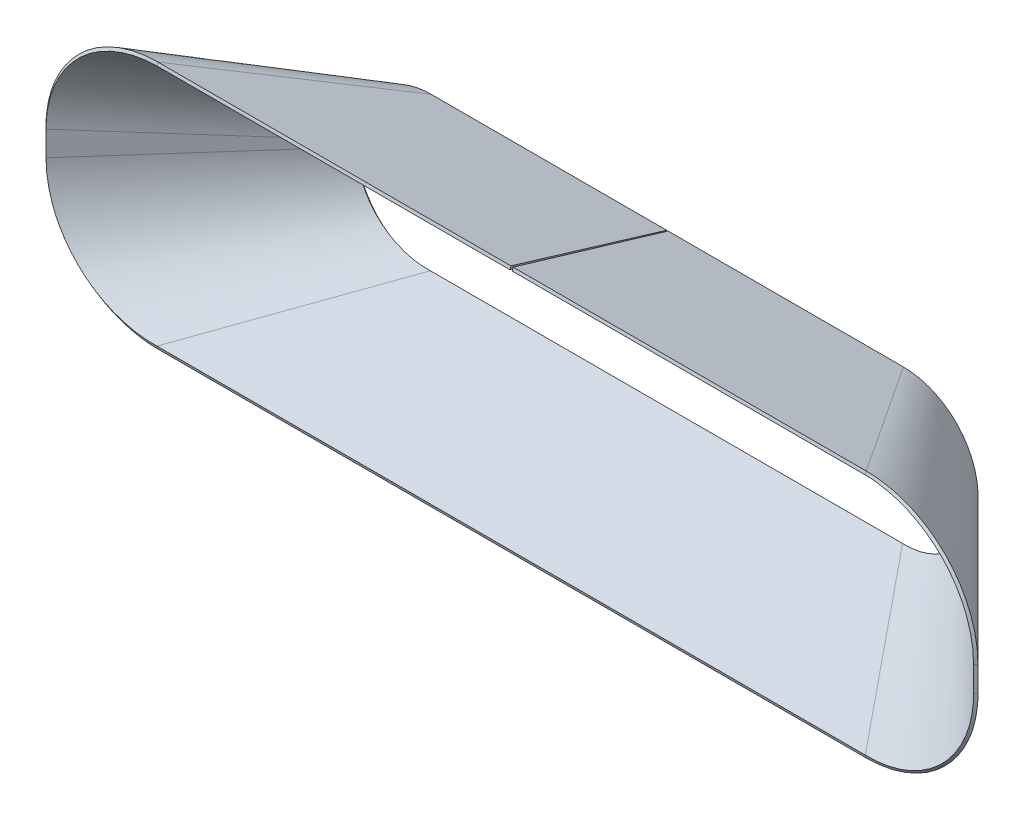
ISO-10303-21;
HEADER;
FILE_DESCRIPTION(('STEP AP214'),'2;1');
FILE_NAME('part.step','',(''),(''),'','','');
FILE_SCHEMA(('AUTOMOTIVE_DESIGN { 1 0 10303 214 1 1 1 1 }'));
ENDSEC;
DATA;
#1=APPLICATION_CONTEXT('core data for automotive mechanical design processes');
#2=APPLICATION_PROTOCOL_DEFINITION('international standard','automotive_design',2000,#1);
#3=PRODUCT_CONTEXT('',#1,'mechanical');
#4=PRODUCT('Part','Part','',(#3));
#5=PRODUCT_RELATED_PRODUCT_CATEGORY('part','',(#4));
#6=PRODUCT_DEFINITION_FORMATION('','',#4);
#7=PRODUCT_DEFINITION_CONTEXT('part definition',#1,'design');
#8=PRODUCT_DEFINITION('design','',#6,#7);
#9=PRODUCT_DEFINITION_SHAPE('','',#8);
#10=(LENGTH_UNIT() NAMED_UNIT(*) SI_UNIT(.MILLI.,.METRE.));
#11=(NAMED_UNIT(*) PLANE_ANGLE_UNIT() SI_UNIT($,.RADIAN.));
#12=(NAMED_UNIT(*) SI_UNIT($,.STERADIAN.) SOLID_ANGLE_UNIT());
#13=UNCERTAINTY_MEASURE_WITH_UNIT(LENGTH_MEASURE(1.E-05),#10,'distance_accuracy_value','');
#14=(GEOMETRIC_REPRESENTATION_CONTEXT(3) GLOBAL_UNCERTAINTY_ASSIGNED_CONTEXT((#13)) GLOBAL_UNIT_ASSIGNED_CONTEXT((#10,
#11,#12)) REPRESENTATION_CONTEXT('',''));
#15=CARTESIAN_POINT('',(0.,0.,0.));
#16=DIRECTION('',(0.,0.,1.));
#17=DIRECTION('',(1.,0.,0.));
#18=AXIS2_PLACEMENT_3D('',#15,#16,#17);
#19=CARTESIAN_POINT('',(-0.872686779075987,100.,375.));
#20=DIRECTION('',(0.,-0.287347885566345,-0.957826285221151));
#21=DIRECTION('',(-1.,0.,0.));
#22=AXIS2_PLACEMENT_3D('',#19,#20,#21);
#23=PLANE('',#22);
#24=DIRECTION('',(0.,-0.957826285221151,0.287347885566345));
#25=VECTOR('',#24,1.);
#26=CARTESIAN_POINT('',(-0.872686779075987,100.,375.));
#27=LINE('',#26,#25);
#28=CARTESIAN_POINT('',(-0.872686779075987,100.,375.));
#29=VERTEX_POINT('',#28);
#30=CARTESIAN_POINT('',(-0.872686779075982,97.6054342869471,375.718369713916));
#31=VERTEX_POINT('',#30);
#32=EDGE_CURVE('E14',#29,#31,#27,.T.);
#33=ORIENTED_EDGE('',*,*,#32,.F.);
#34=DIRECTION('',(-1.,0.,0.));
#35=VECTOR('',#34,1.);
#36=CARTESIAN_POINT('',(-0.872686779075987,100.,375.));
#37=LINE('',#36,#35);
#38=CARTESIAN_POINT('',(-284.999999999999,99.9999999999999,375.));
#39=VERTEX_POINT('',#38);
#40=EDGE_CURVE('E645',#29,#39,#37,.T.);
#41=ORIENTED_EDGE('',*,*,#40,.T.);
#42=CARTESIAN_POINT('',(-284.999999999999,97.6054342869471,375.718369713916));
#43=CARTESIAN_POINT('',(-284.999999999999,99.9999999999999,375.));
#44=B_SPLINE_CURVE_WITH_KNOTS('',1,(#42,#43),.UNSPECIFIED.,.F.,.F.,(2,2),(0.,1.),.UNSPECIFIED.);
#45=CARTESIAN_POINT('',(-284.999999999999,97.6054342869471,375.718369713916));
#46=VERTEX_POINT('',#45);
#47=EDGE_CURVE('E128',#39,#46,#44,.F.);
#48=ORIENTED_EDGE('',*,*,#47,.T.);
#49=DIRECTION('',(1.,0.,0.));
#50=VECTOR('',#49,1.);
#51=CARTESIAN_POINT('',(-190.,97.6054342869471,375.718369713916));
#52=LINE('',#51,#50);
#53=EDGE_CURVE('E650',#31,#46,#52,.F.);
#54=ORIENTED_EDGE('',*,*,#53,.F.);
#55=EDGE_LOOP('',(#33,#41,#48,#54));
#56=FACE_BOUND('',#55,.T.);
#57=ADVANCED_FACE('F118',(#56),#23,.F.);
#58=CARTESIAN_POINT('',(-284.999999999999,97.6054342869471,375.718369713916));
#59=CARTESIAN_POINT('',(-296.615490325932,97.6717539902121,375.939435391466));
#60=CARTESIAN_POINT('',(-308.026816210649,95.4527414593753,376.122655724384));
#61=CARTESIAN_POINT('',(-329.205398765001,86.8601837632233,376.406149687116));
#62=CARTESIAN_POINT('',(-338.970741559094,80.4864644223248,376.509212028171));
#63=CARTESIAN_POINT('',(-355.574333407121,64.0586105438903,376.660787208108));
#64=CARTESIAN_POINT('',(-362.070758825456,54.342981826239,376.707597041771));
#65=CARTESIAN_POINT('',(-370.903319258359,33.1630916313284,376.764615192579));
#66=CARTESIAN_POINT('',(-373.239255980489,21.7002284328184,376.774789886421));
#67=CARTESIAN_POINT('',(-373.232233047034,9.99999999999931,376.767766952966));
#68=CARTESIAN_POINT('',(-284.999999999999,99.9999999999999,375.));
#69=CARTESIAN_POINT('',(-296.93440428,100.,375.));
#70=CARTESIAN_POINT('',(-308.624857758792,97.6293516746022,375.));
#71=CARTESIAN_POINT('',(-330.258011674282,88.6686059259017,375.));
#72=CARTESIAN_POINT('',(-340.20071211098,82.078508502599,375.));
#73=CARTESIAN_POINT('',(-357.078508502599,65.2007121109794,375.));
#74=CARTESIAN_POINT('',(-363.668605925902,55.258011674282,375.));
#75=CARTESIAN_POINT('',(-372.629351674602,33.6248577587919,375.));
#76=CARTESIAN_POINT('',(-375.,21.9344042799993,375.));
#77=CARTESIAN_POINT('',(-375.,9.9999999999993,375.));
#78=B_SPLINE_SURFACE_WITH_KNOTS('',1,3,((#58,#59,#60,#61,#62,#63,#64,#65,#66,#67),(#68,#69,#70,
#71,#72,#73,#74,#75,#76,#77)),.UNSPECIFIED.,.F.,.F.,.F.,(2,2),(4,2,2,2,4),(0.,1.),(0.,0.25,0.5,
0.75,1.),.UNSPECIFIED.);
#79=CARTESIAN_POINT('',(-284.999999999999,99.9999999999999,375.));
#80=CARTESIAN_POINT('',(-296.93440428,100.,375.));
#81=CARTESIAN_POINT('',(-308.624857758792,97.6293516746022,375.));
#82=CARTESIAN_POINT('',(-330.258011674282,88.6686059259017,375.));
#83=CARTESIAN_POINT('',(-340.20071211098,82.078508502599,375.));
#84=CARTESIAN_POINT('',(-357.078508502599,65.2007121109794,375.));
#85=CARTESIAN_POINT('',(-363.668605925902,55.258011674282,375.));
#86=CARTESIAN_POINT('',(-372.629351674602,33.6248577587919,375.));
#87=CARTESIAN_POINT('',(-375.,21.9344042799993,375.));
#88=CARTESIAN_POINT('',(-375.,9.9999999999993,375.));
#89=B_SPLINE_CURVE_WITH_KNOTS('',3,(#79,#80,#81,#82,#83,#84,#85,#86,#87,#88),.UNSPECIFIED.,.F.,
.F.,(4,2,2,2,4),(0.,0.25,0.5,0.75,1.),.UNSPECIFIED.);
#90=CARTESIAN_POINT('',(-375.,9.9999999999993,375.));
#91=VERTEX_POINT('',#90);
#92=EDGE_CURVE('E289',#39,#91,#89,.T.);
#93=CARTESIAN_POINT('',(-375.,9.9999999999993,375.));
#94=CARTESIAN_POINT('',(-373.232233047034,9.99999999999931,376.767766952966));
#95=B_SPLINE_CURVE_WITH_KNOTS('',1,(#93,#94),.UNSPECIFIED.,.F.,.F.,(2,2),(0.,1.),.UNSPECIFIED.);
#96=CARTESIAN_POINT('',(-373.232233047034,9.9999999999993,376.767766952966));
#97=VERTEX_POINT('',#96);
#98=EDGE_CURVE('E1136',#91,#97,#95,.T.);
#99=CARTESIAN_POINT('',(-285.000000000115,97.6054342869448,375.718369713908));
#100=CARTESIAN_POINT('',(-286.44882136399,97.6137451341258,375.745949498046));
#101=CARTESIAN_POINT('',(-287.897860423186,97.5864681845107,375.773054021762));
#102=CARTESIAN_POINT('',(-290.78697893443,97.461040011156,375.826096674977));
#103=CARTESIAN_POINT('',(-292.227070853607,97.3631775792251,375.852039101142));
#104=CARTESIAN_POINT('',(-295.095973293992,97.0973875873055,375.902683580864));
#105=CARTESIAN_POINT('',(-296.524805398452,96.9296938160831,375.927389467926));
#106=CARTESIAN_POINT('',(-299.368831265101,96.5251020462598,375.97552260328));
#107=CARTESIAN_POINT('',(-300.784050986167,96.2883869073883,375.998953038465));
#108=CARTESIAN_POINT('',(-303.598467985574,95.7465993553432,376.04451797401));
#109=CARTESIAN_POINT('',(-304.997691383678,95.4416628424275,376.06665494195));
#110=CARTESIAN_POINT('',(-307.777706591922,94.7642906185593,376.109635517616));
#111=CARTESIAN_POINT('',(-309.158520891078,94.3919473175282,376.130480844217));
#112=CARTESIAN_POINT('',(-311.899288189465,93.5806295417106,376.170895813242));
#113=CARTESIAN_POINT('',(-313.25925653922,93.1417069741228,376.190466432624));
#114=CARTESIAN_POINT('',(-315.955885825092,92.1981125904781,376.228361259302));
#115=CARTESIAN_POINT('',(-317.292551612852,91.693454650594,376.246685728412));
#116=CARTESIAN_POINT('',(-319.940117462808,90.6192863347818,376.282125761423));
#117=CARTESIAN_POINT('',(-321.251008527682,90.0497537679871,376.299240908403));
#118=CARTESIAN_POINT('',(-323.844558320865,88.8467483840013,376.33230522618));
#119=CARTESIAN_POINT('',(-325.127190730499,88.2132187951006,376.348253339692));
#120=CARTESIAN_POINT('',(-327.661751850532,86.8831465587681,376.379029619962));
#121=CARTESIAN_POINT('',(-328.913633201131,86.186513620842,376.393856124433));
#122=CARTESIAN_POINT('',(-331.38421919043,84.7311759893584,376.422436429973));
#123=CARTESIAN_POINT('',(-332.602851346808,83.9723482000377,376.436187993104));
#124=CARTESIAN_POINT('',(-335.004467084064,82.3935751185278,376.46266561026));
#125=CARTESIAN_POINT('',(-336.187348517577,81.573474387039,376.475388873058));
#126=CARTESIAN_POINT('',(-338.514994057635,79.8731207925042,376.49985543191));
#127=CARTESIAN_POINT('',(-339.65962126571,78.9926804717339,376.511595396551));
#128=CARTESIAN_POINT('',(-341.908295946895,77.1726238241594,376.534140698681));
#129=CARTESIAN_POINT('',(-343.012166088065,76.2327883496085,376.544942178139));
#130=CARTESIAN_POINT('',(-345.176867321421,74.2949217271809,376.565647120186));
#131=CARTESIAN_POINT('',(-346.237474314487,73.2966401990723,376.575546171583));
#132=CARTESIAN_POINT('',(-348.307867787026,71.2481704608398,376.594455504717));
#133=CARTESIAN_POINT('',(-349.317641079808,70.1979689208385,376.603465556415));
#134=CARTESIAN_POINT('',(-351.279454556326,68.0528855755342,376.620613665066));
#135=CARTESIAN_POINT('',(-352.231715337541,66.9582055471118,376.628755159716));
#136=CARTESIAN_POINT('',(-354.077450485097,64.7266343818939,376.644214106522));
#137=CARTESIAN_POINT('',(-354.971114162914,63.589899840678,376.651534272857));
#138=CARTESIAN_POINT('',(-356.698608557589,61.276698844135,376.665401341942));
#139=CARTESIAN_POINT('',(-357.532596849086,60.100350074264,376.671950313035));
#140=CARTESIAN_POINT('',(-359.139696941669,57.7104041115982,376.68431980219));
#141=CARTESIAN_POINT('',(-359.912934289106,56.4968913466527,376.690141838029));
#142=CARTESIAN_POINT('',(-361.39749413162,54.0351051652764,376.701098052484));
#143=CARTESIAN_POINT('',(-362.108909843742,52.7868879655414,376.70623327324));
#144=CARTESIAN_POINT('',(-363.468793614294,50.2581835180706,376.715851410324));
#145=CARTESIAN_POINT('',(-364.117322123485,48.9777287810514,376.720334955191));
#146=CARTESIAN_POINT('',(-365.35040498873,46.3870417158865,376.728680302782));
#147=CARTESIAN_POINT('',(-365.934986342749,45.0768222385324,376.732542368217));
#148=CARTESIAN_POINT('',(-367.039155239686,42.429098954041,376.739670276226));
#149=CARTESIAN_POINT('',(-367.55873529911,41.0915920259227,376.742936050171));
#150=CARTESIAN_POINT('',(-368.531889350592,38.3917869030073,376.748891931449));
#151=CARTESIAN_POINT('',(-368.985419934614,37.0294730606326,376.751581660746));
#152=CARTESIAN_POINT('',(-369.825470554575,34.2825459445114,376.756401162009));
#153=CARTESIAN_POINT('',(-370.211909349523,32.8979078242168,376.758530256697));
#154=CARTESIAN_POINT('',(-370.916780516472,30.1088216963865,376.762239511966));
#155=CARTESIAN_POINT('',(-371.235091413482,28.7043429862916,376.763818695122));
#156=CARTESIAN_POINT('',(-371.802718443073,25.878061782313,376.766434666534));
#157=CARTESIAN_POINT('',(-372.051869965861,24.4562262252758,376.767470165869));
#158=CARTESIAN_POINT('',(-372.480203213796,21.5977128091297,376.769001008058));
#159=CARTESIAN_POINT('',(-372.659173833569,20.1610033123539,376.769494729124));
#160=CARTESIAN_POINT('',(-372.946163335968,17.2752173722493,376.7699403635));
#161=CARTESIAN_POINT('',(-373.053920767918,15.8261149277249,376.769890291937));
#162=CARTESIAN_POINT('',(-373.197571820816,12.9180115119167,376.769242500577));
#163=CARTESIAN_POINT('',(-373.233149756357,11.4589949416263,376.76864239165));
#164=CARTESIAN_POINT('',(-373.232233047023,10.0000000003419,376.767766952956));
#165=B_SPLINE_CURVE_WITH_KNOTS('',3,(#99,#100,#101,#102,#103,#104,#105,#106,#107,#108,#109,#110,
#111,#112,#113,#114,#115,#116,#117,#118,#119,#120,#121,#122,#123,#124,#125,#126,#127,#128,#129,
#130,#131,#132,#133,#134,#135,#136,#137,#138,#139,#140,#141,#142,#143,#144,#145,#146,#147,#148,
#149,#150,#151,#152,#153,#154,#155,#156,#157,#158,#159,#160,#161,#162,#163,#164),.UNSPECIFIED.,
.F.,.F.,(4,2,2,2,2,2,2,2,2,2,2,2,2,2,2,2,2,2,2,2,2,2,2,2,2,2,2,2,2,2,2,2,4),(0.,
4.34689374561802,8.67610286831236,12.9909332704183,17.2944345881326,21.5894382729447,
25.8785977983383,30.1644303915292,34.4493597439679,38.7357592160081,43.0259951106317,
47.3224696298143,51.6276631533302,55.944175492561,60.2747657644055,64.6223905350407,
68.9902398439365,73.3592164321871,77.7102036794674,82.0463604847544,86.3706092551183,
90.6856727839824,94.9941127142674,99.2983691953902,103.600801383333,107.903728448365,
112.209470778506,116.520391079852,120.83893505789,125.16767136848,129.509330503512,
133.866842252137,138.243371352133),.UNSPECIFIED.);
#166=EDGE_CURVE('E660',#46,#97,#165,.T.);
#167=ORIENTED_EDGE('',*,*,#47,.F.);
#168=ORIENTED_EDGE('',*,*,#92,.T.);
#169=ORIENTED_EDGE('',*,*,#98,.T.);
#170=ORIENTED_EDGE('',*,*,#166,.F.);
#171=EDGE_LOOP('',(#167,#168,#169,#170));
#172=FACE_BOUND('',#171,.T.);
#173=ADVANCED_FACE('F1141',(#172),#78,.T.);
#174=CARTESIAN_POINT('',(-375.,9.9999999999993,375.));
#175=DIRECTION('',(-0.707106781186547,0.,0.707106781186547));
#176=DIRECTION('',(0.,-1.,0.));
#177=AXIS2_PLACEMENT_3D('',#174,#175,#176);
#178=PLANE('',#177);
#179=ORIENTED_EDGE('',*,*,#98,.F.);
#180=DIRECTION('',(0.,-1.,0.));
#181=VECTOR('',#180,1.);
#182=CARTESIAN_POINT('',(-375.,9.9999999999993,375.));
#183=LINE('',#182,#181);
#184=CARTESIAN_POINT('',(-375.,-9.99999999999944,375.));
#185=VERTEX_POINT('',#184);
#186=EDGE_CURVE('E703',#91,#185,#183,.T.);
#187=ORIENTED_EDGE('',*,*,#186,.T.);
#188=CARTESIAN_POINT('',(-373.232233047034,-9.99999999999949,376.767766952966));
#189=CARTESIAN_POINT('',(-375.,-9.99999999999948,375.));
#190=B_SPLINE_CURVE_WITH_KNOTS('',1,(#188,#189),.UNSPECIFIED.,.F.,.F.,(2,2),(0.,1.),.UNSPECIFIED.);
#191=CARTESIAN_POINT('',(-373.232233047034,-9.99999999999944,376.767766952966));
#192=VERTEX_POINT('',#191);
#193=EDGE_CURVE('E1115',#185,#192,#190,.F.);
#194=ORIENTED_EDGE('',*,*,#193,.T.);
#195=DIRECTION('',(0.,1.,0.));
#196=VECTOR('',#195,1.);
#197=CARTESIAN_POINT('',(-373.232233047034,-2.4999999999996,376.767766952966));
#198=LINE('',#197,#196);
#199=EDGE_CURVE('E680',#97,#192,#198,.F.);
#200=ORIENTED_EDGE('',*,*,#199,.F.);
#201=EDGE_LOOP('',(#179,#187,#194,#200));
#202=FACE_BOUND('',#201,.T.);
#203=ADVANCED_FACE('F1075',(#202),#178,.T.);
#204=CARTESIAN_POINT('',(-373.232233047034,-9.99999999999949,376.767766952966));
#205=CARTESIAN_POINT('',(-373.239255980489,-21.7002284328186,376.774789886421));
#206=CARTESIAN_POINT('',(-370.903319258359,-33.1630916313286,376.764615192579));
#207=CARTESIAN_POINT('',(-362.070758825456,-54.3429818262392,376.707597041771));
#208=CARTESIAN_POINT('',(-355.574333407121,-64.0586105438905,376.660787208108));
#209=CARTESIAN_POINT('',(-338.970741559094,-80.486464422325,376.509212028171));
#210=CARTESIAN_POINT('',(-329.205398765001,-86.8601837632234,376.406149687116));
#211=CARTESIAN_POINT('',(-308.026816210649,-95.4527414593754,376.122655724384));
#212=CARTESIAN_POINT('',(-296.615490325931,-97.6717539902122,375.939435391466));
#213=CARTESIAN_POINT('',(-284.999999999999,-97.6054342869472,375.718369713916));
#214=CARTESIAN_POINT('',(-375.,-9.99999999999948,375.));
#215=CARTESIAN_POINT('',(-375.,-21.9344042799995,375.));
#216=CARTESIAN_POINT('',(-372.629351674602,-33.6248577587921,375.));
#217=CARTESIAN_POINT('',(-363.668605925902,-55.2580116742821,375.));
#218=CARTESIAN_POINT('',(-357.078508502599,-65.2007121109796,375.));
#219=CARTESIAN_POINT('',(-340.20071211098,-82.0785085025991,375.));
#220=CARTESIAN_POINT('',(-330.258011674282,-88.6686059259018,375.));
#221=CARTESIAN_POINT('',(-308.624857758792,-97.6293516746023,375.));
#222=CARTESIAN_POINT('',(-296.934404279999,-100.,375.));
#223=CARTESIAN_POINT('',(-284.999999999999,-100.,375.));
#224=B_SPLINE_SURFACE_WITH_KNOTS('',1,3,((#204,#205,#206,#207,#208,#209,#210,#211,#212,#213),
(#214,#215,#216,#217,#218,#219,#220,#221,#222,#223)),.UNSPECIFIED.,.F.,.F.,.F.,(2,2),(4,2,2,2,
4),(0.,1.),(0.,0.25,0.5,0.75,1.),.UNSPECIFIED.);
#225=CARTESIAN_POINT('',(-375.,-9.99999999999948,375.));
#226=CARTESIAN_POINT('',(-375.,-21.9344042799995,375.));
#227=CARTESIAN_POINT('',(-372.629351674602,-33.6248577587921,375.));
#228=CARTESIAN_POINT('',(-363.668605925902,-55.2580116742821,375.));
#229=CARTESIAN_POINT('',(-357.078508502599,-65.2007121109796,375.));
#230=CARTESIAN_POINT('',(-340.20071211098,-82.0785085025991,375.));
#231=CARTESIAN_POINT('',(-330.258011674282,-88.6686059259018,375.));
#232=CARTESIAN_POINT('',(-308.624857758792,-97.6293516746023,375.));
#233=CARTESIAN_POINT('',(-296.934404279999,-100.,375.));
#234=CARTESIAN_POINT('',(-284.999999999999,-100.,375.));
#235=B_SPLINE_CURVE_WITH_KNOTS('',3,(#225,#226,#227,#228,#229,#230,#231,#232,#233,#234),
.UNSPECIFIED.,.F.,.F.,(4,2,2,2,4),(0.,0.25,0.5,0.75,1.),.UNSPECIFIED.);
#236=CARTESIAN_POINT('',(-284.999999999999,-100.,375.));
#237=VERTEX_POINT('',#236);
#238=EDGE_CURVE('E722',#185,#237,#235,.T.);
#239=CARTESIAN_POINT('',(-284.999999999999,-100.,375.));
#240=CARTESIAN_POINT('',(-284.999999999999,-97.6054342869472,375.718369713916));
#241=B_SPLINE_CURVE_WITH_KNOTS('',1,(#239,#240),.UNSPECIFIED.,.F.,.F.,(2,2),(0.,1.),.UNSPECIFIED.);
#242=CARTESIAN_POINT('',(-284.999999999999,-97.6054342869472,375.718369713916));
#243=VERTEX_POINT('',#242);
#244=EDGE_CURVE('E1103',#237,#243,#241,.T.);
#245=CARTESIAN_POINT('',(-373.232233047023,-10.0000000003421,376.767766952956));
#246=CARTESIAN_POINT('',(-373.23314975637,-11.4589949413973,376.768642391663));
#247=CARTESIAN_POINT('',(-373.197571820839,-12.9180115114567,376.769242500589));
#248=CARTESIAN_POINT('',(-373.053920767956,-15.8261149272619,376.76989029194));
#249=CARTESIAN_POINT('',(-372.946163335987,-17.2752173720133,376.769940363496));
#250=CARTESIAN_POINT('',(-372.659173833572,-20.161003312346,376.769494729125));
#251=CARTESIAN_POINT('',(-372.48020321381,-21.597712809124,376.769001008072));
#252=CARTESIAN_POINT('',(-372.051869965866,-24.4562262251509,376.767470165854));
#253=CARTESIAN_POINT('',(-371.802718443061,-25.8780617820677,376.766434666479));
#254=CARTESIAN_POINT('',(-371.235091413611,-28.7043429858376,376.763818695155));
#255=CARTESIAN_POINT('',(-370.91678051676,-30.1088216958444,376.762239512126));
#256=CARTESIAN_POINT('',(-370.211909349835,-32.8979078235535,376.758530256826));
#257=CARTESIAN_POINT('',(-369.825470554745,-34.2825459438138,376.75640116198));
#258=CARTESIAN_POINT('',(-368.985419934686,-37.0294730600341,376.751581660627));
#259=CARTESIAN_POINT('',(-368.531889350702,-38.3917869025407,376.7488919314));
#260=CARTESIAN_POINT('',(-367.558735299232,-41.0915920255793,376.742936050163));
#261=CARTESIAN_POINT('',(-367.039155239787,-42.4290989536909,376.73967027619));
#262=CARTESIAN_POINT('',(-365.934986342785,-45.0768222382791,376.732542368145));
#263=CARTESIAN_POINT('',(-365.350404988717,-46.3870417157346,376.728680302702));
#264=CARTESIAN_POINT('',(-364.11732212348,-48.9777287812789,376.720334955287));
#265=CARTESIAN_POINT('',(-363.468793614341,-50.2581835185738,376.715851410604));
#266=CARTESIAN_POINT('',(-362.108909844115,-52.7868879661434,376.706233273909));
#267=CARTESIAN_POINT('',(-361.39749413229,-54.0351051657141,376.701098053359));
#268=CARTESIAN_POINT('',(-359.912934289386,-56.496891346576,376.690141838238));
#269=CARTESIAN_POINT('',(-359.139696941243,-57.7104041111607,376.684319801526));
#270=CARTESIAN_POINT('',(-357.532596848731,-60.1003500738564,376.671950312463));
#271=CARTESIAN_POINT('',(-356.698608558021,-61.2766988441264,376.665401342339));
#272=CARTESIAN_POINT('',(-354.971114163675,-63.5898998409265,376.651534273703));
#273=CARTESIAN_POINT('',(-354.077450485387,-64.7266343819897,376.644214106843));
#274=CARTESIAN_POINT('',(-352.231715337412,-66.9582055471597,376.628755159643));
#275=CARTESIAN_POINT('',(-351.279454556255,-68.0528855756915,376.620613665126));
#276=CARTESIAN_POINT('',(-349.3176410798,-70.1979689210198,376.603465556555));
#277=CARTESIAN_POINT('',(-348.307867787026,-71.2481704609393,376.594455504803));
#278=CARTESIAN_POINT('',(-346.237474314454,-73.2966401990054,376.575546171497));
#279=CARTESIAN_POINT('',(-345.176867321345,-74.2949217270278,376.565647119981));
#280=CARTESIAN_POINT('',(-343.012166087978,-76.2327883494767,376.54494217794));
#281=CARTESIAN_POINT('',(-341.908295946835,-77.1726238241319,376.534140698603));
#282=CARTESIAN_POINT('',(-339.659621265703,-78.9926804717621,376.511595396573));
#283=CARTESIAN_POINT('',(-338.514994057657,-79.8731207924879,376.499855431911));
#284=CARTESIAN_POINT('',(-336.187348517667,-81.5734743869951,376.475388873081));
#285=CARTESIAN_POINT('',(-335.004467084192,-82.3935751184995,376.462665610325));
#286=CARTESIAN_POINT('',(-332.602851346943,-83.972348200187,376.436187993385));
#287=CARTESIAN_POINT('',(-331.384219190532,-84.7311759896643,376.422436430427));
#288=CARTESIAN_POINT('',(-328.91363320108,-86.1865136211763,376.393856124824));
#289=CARTESIAN_POINT('',(-327.661751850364,-86.8831465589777,376.379029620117));
#290=CARTESIAN_POINT('',(-325.127190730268,-88.2132187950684,376.348253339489));
#291=CARTESIAN_POINT('',(-323.844558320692,-88.8467483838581,376.332305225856));
#292=CARTESIAN_POINT('',(-321.251008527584,-90.0497537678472,376.299240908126));
#293=CARTESIAN_POINT('',(-319.940117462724,-90.6192863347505,376.282125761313));
#294=CARTESIAN_POINT('',(-317.29255161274,-91.6934546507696,376.24668572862));
#295=CARTESIAN_POINT('',(-315.955885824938,-92.1981125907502,376.22836125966));
#296=CARTESIAN_POINT('',(-313.259256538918,-93.1417069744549,376.190466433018));
#297=CARTESIAN_POINT('',(-311.899288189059,-93.5806295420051,376.170895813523));
#298=CARTESIAN_POINT('',(-309.15852089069,-94.3919473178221,376.130480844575));
#299=CARTESIAN_POINT('',(-307.77770659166,-94.7642906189,376.109635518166));
#300=CARTESIAN_POINT('',(-304.997691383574,-95.4416628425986,376.066654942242));
#301=CARTESIAN_POINT('',(-303.598467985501,-95.7465993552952,376.044517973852));
#302=CARTESIAN_POINT('',(-300.784050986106,-96.2883869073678,375.998953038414));
#303=CARTESIAN_POINT('',(-299.368831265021,-96.5251020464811,375.975522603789));
#304=CARTESIAN_POINT('',(-296.524805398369,-96.929693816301,375.927389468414));
#305=CARTESIAN_POINT('',(-295.095973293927,-97.0973875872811,375.902683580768));
#306=CARTESIAN_POINT('',(-292.227070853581,-97.3631775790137,375.852039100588));
#307=CARTESIAN_POINT('',(-290.786978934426,-97.4610400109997,375.82609667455));
#308=CARTESIAN_POINT('',(-287.897860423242,-97.5864681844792,375.77305402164));
#309=CARTESIAN_POINT('',(-286.448821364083,-97.6137451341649,375.745949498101));
#310=CARTESIAN_POINT('',(-285.000000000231,-97.6054342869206,375.718369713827));
#311=B_SPLINE_CURVE_WITH_KNOTS('',3,(#245,#246,#247,#248,#249,#250,#251,#252,#253,#254,#255,
#256,#257,#258,#259,#260,#261,#262,#263,#264,#265,#266,#267,#268,#269,#270,#271,#272,#273,#274,
#275,#276,#277,#278,#279,#280,#281,#282,#283,#284,#285,#286,#287,#288,#289,#290,#291,#292,#293,
#294,#295,#296,#297,#298,#299,#300,#301,#302,#303,#304,#305,#306,#307,#308,#309,#310),
.UNSPECIFIED.,.F.,.F.,(4,2,2,2,2,2,2,2,2,2,2,2,2,2,2,2,2,2,2,2,2,2,2,2,2,2,2,2,2,2,2,2,4),(0.,
4.37652909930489,8.73404084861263,13.0756999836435,17.404436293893,21.7229802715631,
26.0339005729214,30.3396429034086,34.6425699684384,38.945002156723,43.2492586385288,
47.5576985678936,51.8727620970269,56.1970108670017,60.5331676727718,64.8841549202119,
69.2531315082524,73.6209808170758,77.96860558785,82.2991958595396,86.6157081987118,
90.9209017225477,95.2173762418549,99.5076121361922,103.794011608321,108.078940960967,
112.364773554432,116.65393307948,120.94893676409,125.252438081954,129.567268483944,
133.896477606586,138.243371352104),.UNSPECIFIED.);
#312=EDGE_CURVE('E1037',#192,#243,#311,.T.);
#313=ORIENTED_EDGE('',*,*,#193,.F.);
#314=ORIENTED_EDGE('',*,*,#238,.T.);
#315=ORIENTED_EDGE('',*,*,#244,.T.);
#316=ORIENTED_EDGE('',*,*,#312,.F.);
#317=EDGE_LOOP('',(#313,#314,#315,#316));
#318=FACE_BOUND('',#317,.T.);
#319=ADVANCED_FACE('F1064',(#318),#224,.T.);
#320=CARTESIAN_POINT('',(284.999999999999,-100.,375.));
#321=DIRECTION('',(0.,-0.287347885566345,0.957826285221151));
#322=DIRECTION('',(-1.,0.,0.));
#323=AXIS2_PLACEMENT_3D('',#320,#321,#322);
#324=PLANE('',#323);
#325=ORIENTED_EDGE('',*,*,#244,.F.);
#326=DIRECTION('',(-1.,0.,0.));
#327=VECTOR('',#326,1.);
#328=CARTESIAN_POINT('',(284.999999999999,-100.,375.));
#329=LINE('',#328,#327);
#330=CARTESIAN_POINT('',(284.999999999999,-100.,375.));
#331=VERTEX_POINT('',#330);
#332=EDGE_CURVE('E1243',#331,#237,#329,.T.);
#333=ORIENTED_EDGE('',*,*,#332,.F.);
#334=CARTESIAN_POINT('',(284.999999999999,-97.6054342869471,375.718369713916));
#335=CARTESIAN_POINT('',(284.999999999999,-100.,375.));
#336=B_SPLINE_CURVE_WITH_KNOTS('',1,(#334,#335),.UNSPECIFIED.,.F.,.F.,(2,2),(0.,1.),.UNSPECIFIED.);
#337=CARTESIAN_POINT('',(284.999999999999,-97.6054342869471,375.718369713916));
#338=VERTEX_POINT('',#337);
#339=EDGE_CURVE('E1181',#331,#338,#336,.F.);
#340=ORIENTED_EDGE('',*,*,#339,.T.);
#341=DIRECTION('',(1.,0.,0.));
#342=VECTOR('',#341,1.);
#343=CARTESIAN_POINT('',(-2.78066171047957E-13,-97.6054342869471,375.718369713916));
#344=LINE('',#343,#342);
#345=EDGE_CURVE('E1259',#338,#243,#344,.F.);
#346=ORIENTED_EDGE('',*,*,#345,.T.);
#347=EDGE_LOOP('',(#325,#333,#340,#346));
#348=FACE_BOUND('',#347,.T.);
#349=ADVANCED_FACE('F997',(#348),#324,.T.);
#350=CARTESIAN_POINT('',(284.999999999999,-97.6054342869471,375.718369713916));
#351=CARTESIAN_POINT('',(296.615490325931,-97.6717539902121,375.939435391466));
#352=CARTESIAN_POINT('',(308.026816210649,-95.4527414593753,376.122655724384));
#353=CARTESIAN_POINT('',(329.205398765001,-86.8601837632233,376.406149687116));
#354=CARTESIAN_POINT('',(338.970741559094,-80.4864644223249,376.509212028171));
#355=CARTESIAN_POINT('',(355.574333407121,-64.0586105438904,376.660787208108));
#356=CARTESIAN_POINT('',(362.070758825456,-54.3429818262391,376.707597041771));
#357=CARTESIAN_POINT('',(370.903319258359,-33.1630916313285,376.764615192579));
#358=CARTESIAN_POINT('',(373.239255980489,-21.7002284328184,376.774789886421));
#359=CARTESIAN_POINT('',(373.232233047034,-9.99999999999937,376.767766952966));
#360=CARTESIAN_POINT('',(284.999999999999,-100.,375.));
#361=CARTESIAN_POINT('',(296.934404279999,-100.,375.));
#362=CARTESIAN_POINT('',(308.624857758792,-97.6293516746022,375.));
#363=CARTESIAN_POINT('',(330.258011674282,-88.6686059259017,375.));
#364=CARTESIAN_POINT('',(340.20071211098,-82.078508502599,375.));
#365=CARTESIAN_POINT('',(357.078508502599,-65.2007121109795,375.));
#366=CARTESIAN_POINT('',(363.668605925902,-55.258011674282,375.));
#367=CARTESIAN_POINT('',(372.629351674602,-33.6248577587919,375.));
#368=CARTESIAN_POINT('',(375.,-21.9344042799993,375.));
#369=CARTESIAN_POINT('',(375.,-9.99999999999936,375.));
#370=B_SPLINE_SURFACE_WITH_KNOTS('',1,3,((#350,#351,#352,#353,#354,#355,#356,#357,#358,#359),
(#360,#361,#362,#363,#364,#365,#366,#367,#368,#369)),.UNSPECIFIED.,.F.,.F.,.F.,(2,2),(4,2,2,2,
4),(0.,1.),(0.,0.25,0.5,0.75,1.),.UNSPECIFIED.);
#371=CARTESIAN_POINT('',(284.999999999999,-100.,375.));
#372=CARTESIAN_POINT('',(296.934404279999,-100.,375.));
#373=CARTESIAN_POINT('',(308.624857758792,-97.6293516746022,375.));
#374=CARTESIAN_POINT('',(330.258011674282,-88.6686059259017,375.));
#375=CARTESIAN_POINT('',(340.20071211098,-82.078508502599,375.));
#376=CARTESIAN_POINT('',(357.078508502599,-65.2007121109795,375.));
#377=CARTESIAN_POINT('',(363.668605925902,-55.258011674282,375.));
#378=CARTESIAN_POINT('',(372.629351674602,-33.6248577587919,375.));
#379=CARTESIAN_POINT('',(375.,-21.9344042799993,375.));
#380=CARTESIAN_POINT('',(375.,-9.99999999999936,375.));
#381=B_SPLINE_CURVE_WITH_KNOTS('',3,(#371,#372,#373,#374,#375,#376,#377,#378,#379,#380),
.UNSPECIFIED.,.F.,.F.,(4,2,2,2,4),(0.,0.25,0.5,0.75,1.),.UNSPECIFIED.);
#382=CARTESIAN_POINT('',(375.,-9.99999999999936,375.));
#383=VERTEX_POINT('',#382);
#384=EDGE_CURVE('E437',#331,#383,#381,.T.);
#385=CARTESIAN_POINT('',(375.,-9.99999999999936,375.));
#386=CARTESIAN_POINT('',(373.232233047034,-9.99999999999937,376.767766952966));
#387=B_SPLINE_CURVE_WITH_KNOTS('',1,(#385,#386),.UNSPECIFIED.,.F.,.F.,(2,2),(0.,1.),.UNSPECIFIED.);
#388=CARTESIAN_POINT('',(373.232233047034,-9.99999999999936,376.767766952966));
#389=VERTEX_POINT('',#388);
#390=EDGE_CURVE('E981',#383,#389,#387,.T.);
#391=CARTESIAN_POINT('',(285.000000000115,-97.6054342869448,375.718369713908));
#392=CARTESIAN_POINT('',(286.448821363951,-97.6137451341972,375.745949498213));
#393=CARTESIAN_POINT('',(287.897860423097,-97.5864681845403,375.77305402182));
#394=CARTESIAN_POINT('',(290.786978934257,-97.4610400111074,375.826096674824));
#395=CARTESIAN_POINT('',(292.2270708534,-97.3631775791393,375.852039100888));
#396=CARTESIAN_POINT('',(295.095973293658,-97.0973875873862,375.902683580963));
#397=CARTESIAN_POINT('',(296.524805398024,-96.9296938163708,375.927389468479));
#398=CARTESIAN_POINT('',(299.368831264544,-96.5251020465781,375.97552260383));
#399=CARTESIAN_POINT('',(300.784050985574,-96.2883869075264,375.99895303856));
#400=CARTESIAN_POINT('',(303.598467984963,-95.7465993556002,376.044517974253));
#401=CARTESIAN_POINT('',(304.997691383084,-95.4416628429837,376.066654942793));
#402=CARTESIAN_POINT('',(307.777706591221,-94.7642906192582,376.109635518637));
#403=CARTESIAN_POINT('',(309.158520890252,-94.3919473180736,376.130480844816));
#404=CARTESIAN_POINT('',(311.89928818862,-93.5806295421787,376.170895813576));
#405=CARTESIAN_POINT('',(313.259256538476,-93.1417069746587,376.190466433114));
#406=CARTESIAN_POINT('',(315.955885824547,-92.1981125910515,376.228361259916));
#407=CARTESIAN_POINT('',(317.292551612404,-91.6934546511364,376.246685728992));
#408=CARTESIAN_POINT('',(319.940117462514,-90.6192863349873,376.282125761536));
#409=CARTESIAN_POINT('',(321.251008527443,-90.0497537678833,376.299240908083));
#410=CARTESIAN_POINT('',(323.844558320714,-88.8467483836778,376.332305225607));
#411=CARTESIAN_POINT('',(325.127190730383,-88.2132187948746,376.3482533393));
#412=CARTESIAN_POINT('',(327.661751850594,-86.8831465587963,376.379029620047));
#413=CARTESIAN_POINT('',(328.913633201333,-86.1865136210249,376.393856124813));
#414=CARTESIAN_POINT('',(331.38421919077,-84.7311759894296,376.422436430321));
#415=CARTESIAN_POINT('',(332.602851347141,-83.9723481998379,376.436187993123));
#416=CARTESIAN_POINT('',(335.004467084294,-82.3935751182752,376.46266561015));
#417=CARTESIAN_POINT('',(336.187348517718,-81.5734743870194,376.475388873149));
#418=CARTESIAN_POINT('',(338.514994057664,-79.873120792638,376.499855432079));
#419=CARTESIAN_POINT('',(339.659621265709,-78.9926804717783,376.511595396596));
#420=CARTESIAN_POINT('',(341.908295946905,-77.1726238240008,376.534140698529));
#421=CARTESIAN_POINT('',(343.012166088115,-76.2327883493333,376.544942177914));
#422=CARTESIAN_POINT('',(345.176867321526,-74.294921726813,376.565647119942));
#423=CARTESIAN_POINT('',(346.237474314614,-73.2966401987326,376.575546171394));
#424=CARTESIAN_POINT('',(348.30786778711,-71.2481704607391,376.59445550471));
#425=CARTESIAN_POINT('',(349.317641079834,-70.1979689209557,376.603465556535));
#426=CARTESIAN_POINT('',(351.279454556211,-68.0528855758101,376.620613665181));
#427=CARTESIAN_POINT('',(352.231715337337,-66.9582055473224,376.628755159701));
#428=CARTESIAN_POINT('',(354.077450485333,-64.7266343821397,376.6442141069));
#429=CARTESIAN_POINT('',(354.971114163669,-63.5898998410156,376.651534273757));
#430=CARTESIAN_POINT('',(356.698608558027,-61.2766988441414,376.665401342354));
#431=CARTESIAN_POINT('',(357.532596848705,-60.1003500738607,376.671950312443));
#432=CARTESIAN_POINT('',(359.139696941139,-57.710404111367,376.684319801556));
#433=CARTESIAN_POINT('',(359.912934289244,-56.4968913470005,376.690141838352));
#434=CARTESIAN_POINT('',(361.397494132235,-54.0351051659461,376.701098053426));
#435=CARTESIAN_POINT('',(362.108909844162,-52.786887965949,376.706233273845));
#436=CARTESIAN_POINT('',(363.468793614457,-50.2581835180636,376.715851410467));
#437=CARTESIAN_POINT('',(364.117322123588,-48.9777287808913,376.72033495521));
#438=CARTESIAN_POINT('',(365.350404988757,-46.3870417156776,376.728680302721));
#439=CARTESIAN_POINT('',(365.934986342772,-45.0768222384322,376.732542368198));
#440=CARTESIAN_POINT('',(367.039155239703,-42.4290989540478,376.739670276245));
#441=CARTESIAN_POINT('',(367.558735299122,-41.0915920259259,376.742936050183));
#442=CARTESIAN_POINT('',(368.531889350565,-38.3917869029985,376.74889193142));
#443=CARTESIAN_POINT('',(368.985419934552,-37.0294730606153,376.751581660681));
#444=CARTESIAN_POINT('',(369.825470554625,-34.2825459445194,376.756401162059));
#445=CARTESIAN_POINT('',(370.211909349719,-32.8979078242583,376.758530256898));
#446=CARTESIAN_POINT('',(370.916780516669,-30.1088216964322,376.762239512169));
#447=CARTESIAN_POINT('',(371.235091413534,-28.7043429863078,376.763818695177));
#448=CARTESIAN_POINT('',(371.80271844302,-25.8780617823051,376.766434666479));
#449=CARTESIAN_POINT('',(372.051869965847,-24.4562262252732,376.767470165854));
#450=CARTESIAN_POINT('',(372.48020321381,-21.5977128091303,376.769001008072));
#451=CARTESIAN_POINT('',(372.659173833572,-20.1610033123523,376.769494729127));
#452=CARTESIAN_POINT('',(372.946163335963,-17.2752173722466,376.769940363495));
#453=CARTESIAN_POINT('',(373.053920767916,-15.8261149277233,376.769890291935));
#454=CARTESIAN_POINT('',(373.197571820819,-12.918011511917,376.76924250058));
#455=CARTESIAN_POINT('',(373.233149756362,-11.4589949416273,376.768642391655));
#456=CARTESIAN_POINT('',(373.232233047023,-10.000000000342,376.767766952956));
#457=B_SPLINE_CURVE_WITH_KNOTS('',3,(#391,#392,#393,#394,#395,#396,#397,#398,#399,#400,#401,
#402,#403,#404,#405,#406,#407,#408,#409,#410,#411,#412,#413,#414,#415,#416,#417,#418,#419,#420,
#421,#422,#423,#424,#425,#426,#427,#428,#429,#430,#431,#432,#433,#434,#435,#436,#437,#438,#439,
#440,#441,#442,#443,#444,#445,#446,#447,#448,#449,#450,#451,#452,#453,#454,#455,#456),
.UNSPECIFIED.,.F.,.F.,(4,2,2,2,2,2,2,2,2,2,2,2,2,2,2,2,2,2,2,2,2,2,2,2,2,2,2,2,2,2,2,2,4),(0.,
4.34689374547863,8.67610286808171,12.9909332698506,17.2944345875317,21.589438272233,
25.8785977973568,30.1644303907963,34.4493597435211,38.7357592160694,43.0259951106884,
47.3224696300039,51.6276631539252,55.9441754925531,60.2747657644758,64.6223905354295,
68.9902398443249,73.3592164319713,77.7102036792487,82.0463604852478,86.3706092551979,
90.685672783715,94.9941127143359,99.2983691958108,103.600801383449,107.903728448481,
112.209470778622,116.520391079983,120.838935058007,125.167671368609,129.50933050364,
133.866842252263,138.243371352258),.UNSPECIFIED.);
#458=EDGE_CURVE('E864',#338,#389,#457,.T.);
#459=ORIENTED_EDGE('',*,*,#339,.F.);
#460=ORIENTED_EDGE('',*,*,#384,.T.);
#461=ORIENTED_EDGE('',*,*,#390,.T.);
#462=ORIENTED_EDGE('',*,*,#458,.F.);
#463=EDGE_LOOP('',(#459,#460,#461,#462));
#464=FACE_BOUND('',#463,.T.);
#465=ADVANCED_FACE('F986',(#464),#370,.T.);
#466=CARTESIAN_POINT('',(375.,9.99999999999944,375.));
#467=DIRECTION('',(0.707106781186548,0.,0.707106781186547));
#468=DIRECTION('',(0.,-1.,0.));
#469=AXIS2_PLACEMENT_3D('',#466,#467,#468);
#470=PLANE('',#469);
#471=ORIENTED_EDGE('',*,*,#390,.F.);
#472=DIRECTION('',(0.,-1.,0.));
#473=VECTOR('',#472,1.);
#474=CARTESIAN_POINT('',(375.,9.99999999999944,375.));
#475=LINE('',#474,#473);
#476=CARTESIAN_POINT('',(375.,9.99999999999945,375.));
#477=VERTEX_POINT('',#476);
#478=EDGE_CURVE('E444',#477,#383,#475,.T.);
#479=ORIENTED_EDGE('',*,*,#478,.F.);
#480=CARTESIAN_POINT('',(373.232233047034,9.99999999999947,376.767766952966));
#481=CARTESIAN_POINT('',(375.,9.99999999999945,375.));
#482=B_SPLINE_CURVE_WITH_KNOTS('',1,(#480,#481),.UNSPECIFIED.,.F.,.F.,(2,2),(0.,1.),.UNSPECIFIED.);
#483=CARTESIAN_POINT('',(373.232233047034,9.99999999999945,376.767766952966));
#484=VERTEX_POINT('',#483);
#485=EDGE_CURVE('E959',#477,#484,#482,.F.);
#486=ORIENTED_EDGE('',*,*,#485,.T.);
#487=DIRECTION('',(0.,1.,0.));
#488=VECTOR('',#487,1.);
#489=CARTESIAN_POINT('',(373.232233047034,2.4999999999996,376.767766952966));
#490=LINE('',#489,#488);
#491=EDGE_CURVE('E860',#484,#389,#490,.F.);
#492=ORIENTED_EDGE('',*,*,#491,.T.);
#493=EDGE_LOOP('',(#471,#479,#486,#492));
#494=FACE_BOUND('',#493,.T.);
#495=ADVANCED_FACE('F921',(#494),#470,.T.);
#496=CARTESIAN_POINT('',(373.232233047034,9.99999999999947,376.767766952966));
#497=CARTESIAN_POINT('',(373.239255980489,21.7002284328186,376.774789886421));
#498=CARTESIAN_POINT('',(370.903319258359,33.1630916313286,376.764615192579));
#499=CARTESIAN_POINT('',(362.070758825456,54.3429818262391,376.707597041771));
#500=CARTESIAN_POINT('',(355.574333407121,64.0586105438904,376.660787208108));
#501=CARTESIAN_POINT('',(338.970741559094,80.486464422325,376.509212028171));
#502=CARTESIAN_POINT('',(329.205398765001,86.8601837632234,376.406149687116));
#503=CARTESIAN_POINT('',(308.026816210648,95.4527414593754,376.122655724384));
#504=CARTESIAN_POINT('',(296.615490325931,97.6717539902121,375.939435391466));
#505=CARTESIAN_POINT('',(284.999999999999,97.6054342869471,375.718369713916));
#506=CARTESIAN_POINT('',(375.,9.99999999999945,375.));
#507=CARTESIAN_POINT('',(375.,21.9344042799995,375.));
#508=CARTESIAN_POINT('',(372.629351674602,33.624857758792,375.));
#509=CARTESIAN_POINT('',(363.668605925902,55.2580116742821,375.));
#510=CARTESIAN_POINT('',(357.078508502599,65.2007121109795,375.));
#511=CARTESIAN_POINT('',(340.200712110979,82.0785085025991,375.));
#512=CARTESIAN_POINT('',(330.258011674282,88.6686059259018,375.));
#513=CARTESIAN_POINT('',(308.624857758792,97.6293516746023,375.));
#514=CARTESIAN_POINT('',(296.934404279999,100.,375.));
#515=CARTESIAN_POINT('',(284.999999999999,100.,375.));
#516=B_SPLINE_SURFACE_WITH_KNOTS('',1,3,((#496,#497,#498,#499,#500,#501,#502,#503,#504,#505),
(#506,#507,#508,#509,#510,#511,#512,#513,#514,#515)),.UNSPECIFIED.,.F.,.F.,.F.,(2,2),(4,2,2,2,
4),(0.,1.),(0.,0.25,0.5,0.75,1.),.UNSPECIFIED.);
#517=CARTESIAN_POINT('',(375.,9.99999999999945,375.));
#518=CARTESIAN_POINT('',(375.,21.9344042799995,375.));
#519=CARTESIAN_POINT('',(372.629351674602,33.624857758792,375.));
#520=CARTESIAN_POINT('',(363.668605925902,55.2580116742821,375.));
#521=CARTESIAN_POINT('',(357.078508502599,65.2007121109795,375.));
#522=CARTESIAN_POINT('',(340.200712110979,82.0785085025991,375.));
#523=CARTESIAN_POINT('',(330.258011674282,88.6686059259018,375.));
#524=CARTESIAN_POINT('',(308.624857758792,97.6293516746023,375.));
#525=CARTESIAN_POINT('',(296.934404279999,100.,375.));
#526=CARTESIAN_POINT('',(284.999999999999,100.,375.));
#527=B_SPLINE_CURVE_WITH_KNOTS('',3,(#517,#518,#519,#520,#521,#522,#523,#524,#525,#526),
.UNSPECIFIED.,.F.,.F.,(4,2,2,2,4),(0.,0.25,0.5,0.75,1.),.UNSPECIFIED.);
#528=CARTESIAN_POINT('',(284.999999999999,100.,375.));
#529=VERTEX_POINT('',#528);
#530=EDGE_CURVE('E886',#477,#529,#527,.T.);
#531=CARTESIAN_POINT('',(284.999999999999,100.,375.));
#532=CARTESIAN_POINT('',(284.999999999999,97.6054342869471,375.718369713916));
#533=B_SPLINE_CURVE_WITH_KNOTS('',1,(#531,#532),.UNSPECIFIED.,.F.,.F.,(2,2),(0.,1.),.UNSPECIFIED.);
#534=CARTESIAN_POINT('',(284.999999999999,97.6054342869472,375.718369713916));
#535=VERTEX_POINT('',#534);
#536=EDGE_CURVE('E949',#529,#535,#533,.T.);
#537=CARTESIAN_POINT('',(373.232233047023,10.0000000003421,376.767766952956));
#538=CARTESIAN_POINT('',(373.233149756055,11.4589949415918,376.768642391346));
#539=CARTESIAN_POINT('',(373.197571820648,12.9180115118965,376.769242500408));
#540=CARTESIAN_POINT('',(373.053920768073,15.8261149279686,376.769890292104));
#541=CARTESIAN_POINT('',(372.946163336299,17.2752173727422,376.769940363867));
#542=CARTESIAN_POINT('',(372.659173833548,20.1610033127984,376.769494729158));
#543=CARTESIAN_POINT('',(372.480203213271,21.5977128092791,376.769001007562));
#544=CARTESIAN_POINT('',(372.051869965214,24.4562262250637,376.767470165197));
#545=CARTESIAN_POINT('',(371.802718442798,25.8780617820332,376.766434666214));
#546=CARTESIAN_POINT('',(371.235091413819,28.7043429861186,376.763818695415));
#547=CARTESIAN_POINT('',(370.916780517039,30.1088216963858,376.76223951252));
#548=CARTESIAN_POINT('',(370.211909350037,32.8979078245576,376.758530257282));
#549=CARTESIAN_POINT('',(369.825470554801,34.2825459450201,376.756401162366));
#550=CARTESIAN_POINT('',(368.985419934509,37.0294730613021,376.751581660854));
#551=CARTESIAN_POINT('',(368.531889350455,38.391786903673,376.748891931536));
#552=CARTESIAN_POINT('',(367.558735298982,41.0915920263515,376.742936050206));
#553=CARTESIAN_POINT('',(367.039155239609,42.4290989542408,376.739670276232));
#554=CARTESIAN_POINT('',(365.934986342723,45.0768222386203,376.732542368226));
#555=CARTESIAN_POINT('',(365.350404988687,46.3870417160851,376.728680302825));
#556=CARTESIAN_POINT('',(364.11732212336,48.9777287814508,376.720334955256));
#557=CARTESIAN_POINT('',(363.468793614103,50.2581835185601,376.715851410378));
#558=CARTESIAN_POINT('',(362.108909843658,52.7868879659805,376.706233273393));
#559=CARTESIAN_POINT('',(361.397494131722,54.0351051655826,376.701098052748));
#560=CARTESIAN_POINT('',(359.912934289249,56.4968913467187,376.690141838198));
#561=CARTESIAN_POINT('',(359.139696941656,57.7104041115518,376.684319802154));
#562=CARTESIAN_POINT('',(357.532596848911,60.1003500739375,376.671950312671));
#563=CARTESIAN_POINT('',(356.698608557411,61.2766988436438,376.665401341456));
#564=CARTESIAN_POINT('',(354.971114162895,63.5898998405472,376.651534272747));
#565=CARTESIAN_POINT('',(354.077450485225,64.7266343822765,376.644214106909));
#566=CARTESIAN_POINT('',(352.231715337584,66.9582055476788,376.628755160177));
#567=CARTESIAN_POINT('',(351.279454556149,68.052885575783,376.620613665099));
#568=CARTESIAN_POINT('',(349.317641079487,70.1979689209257,376.603465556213));
#569=CARTESIAN_POINT('',(348.307867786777,71.2481704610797,376.594455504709));
#570=CARTESIAN_POINT('',(346.237474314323,73.2966401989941,376.575546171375));
#571=CARTESIAN_POINT('',(345.176867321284,74.2949217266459,376.565647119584));
#572=CARTESIAN_POINT('',(343.012166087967,76.2327883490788,376.544942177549));
#573=CARTESIAN_POINT('',(341.908295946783,77.1726238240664,376.534140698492));
#574=CARTESIAN_POINT('',(339.659621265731,78.9926804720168,376.511595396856));
#575=CARTESIAN_POINT('',(338.514994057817,79.8731207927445,376.499855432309));
#576=CARTESIAN_POINT('',(336.187348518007,81.573474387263,376.475388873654));
#577=CARTESIAN_POINT('',(335.004467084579,82.3935751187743,376.462665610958));
#578=CARTESIAN_POINT('',(332.602851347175,83.9723482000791,376.43618799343));
#579=CARTESIAN_POINT('',(331.384219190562,84.731175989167,376.422436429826));
#580=CARTESIAN_POINT('',(328.913633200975,86.1865136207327,376.393856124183));
#581=CARTESIAN_POINT('',(327.661751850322,86.8831465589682,376.379029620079));
#582=CARTESIAN_POINT('',(325.127190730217,88.2132187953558,376.348253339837));
#583=CARTESIAN_POINT('',(323.844558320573,88.8467483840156,376.332305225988));
#584=CARTESIAN_POINT('',(321.251008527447,90.0497537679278,376.299240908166));
#585=CARTESIAN_POINT('',(319.940117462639,90.6192863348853,376.282125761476));
#586=CARTESIAN_POINT('',(317.292551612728,91.6934546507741,376.246685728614));
#587=CARTESIAN_POINT('',(315.955885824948,92.1981125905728,376.228361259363));
#588=CARTESIAN_POINT('',(313.259256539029,93.1417069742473,376.190466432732));
#589=CARTESIAN_POINT('',(311.899288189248,93.5806295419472,376.17089581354));
#590=CARTESIAN_POINT('',(309.158520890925,94.3919473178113,376.13048084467));
#591=CARTESIAN_POINT('',(307.777706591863,94.7642906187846,376.109635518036));
#592=CARTESIAN_POINT('',(304.997691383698,95.4416628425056,376.066654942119));
#593=CARTESIAN_POINT('',(303.598467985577,95.7465993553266,376.044517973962));
#594=CARTESIAN_POINT('',(300.784050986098,96.2883869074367,375.998953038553));
#595=CARTESIAN_POINT('',(299.368831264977,96.525102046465,375.975522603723));
#596=CARTESIAN_POINT('',(296.524805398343,96.9296938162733,375.927389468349));
#597=CARTESIAN_POINT('',(295.095973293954,97.0973875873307,375.90268358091));
#598=CARTESIAN_POINT('',(292.227070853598,97.3631775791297,375.852039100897));
#599=CARTESIAN_POINT('',(290.786978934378,97.4610400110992,375.826096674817));
#600=CARTESIAN_POINT('',(287.897860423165,97.5864681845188,375.773054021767));
#601=CARTESIAN_POINT('',(286.448821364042,97.6137451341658,375.74594949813));
#602=CARTESIAN_POINT('',(285.000000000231,97.6054342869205,375.718369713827));
#603=B_SPLINE_CURVE_WITH_KNOTS('',3,(#537,#538,#539,#540,#541,#542,#543,#544,#545,#546,#547,
#548,#549,#550,#551,#552,#553,#554,#555,#556,#557,#558,#559,#560,#561,#562,#563,#564,#565,#566,
#567,#568,#569,#570,#571,#572,#573,#574,#575,#576,#577,#578,#579,#580,#581,#582,#583,#584,#585,
#586,#587,#588,#589,#590,#591,#592,#593,#594,#595,#596,#597,#598,#599,#600,#601,#602),
.UNSPECIFIED.,.F.,.F.,(4,2,2,2,2,2,2,2,2,2,2,2,2,2,2,2,2,2,2,2,2,2,2,2,2,2,2,2,2,2,2,2,4),(0.,
4.37652909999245,8.7340408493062,13.0756999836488,17.4044362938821,21.7229802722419,
26.0339005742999,30.3396429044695,34.6425699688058,38.9450021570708,43.2492586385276,
47.5576985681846,51.8727620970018,56.197010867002,60.533167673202,64.884154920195,
69.2531315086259,73.6209808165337,77.9686055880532,82.2991958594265,86.6157081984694,
90.9209017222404,95.2173762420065,99.5076121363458,103.794011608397,108.078940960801,
112.364773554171,116.653933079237,120.948936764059,125.252438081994,129.567268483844,
133.896477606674,138.243371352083),.UNSPECIFIED.);
#604=EDGE_CURVE('E638',#484,#535,#603,.T.);
#605=ORIENTED_EDGE('',*,*,#485,.F.);
#606=ORIENTED_EDGE('',*,*,#530,.T.);
#607=ORIENTED_EDGE('',*,*,#536,.T.);
#608=ORIENTED_EDGE('',*,*,#604,.F.);
#609=EDGE_LOOP('',(#605,#606,#607,#608));
#610=FACE_BOUND('',#609,.T.);
#611=ADVANCED_FACE('F908',(#610),#516,.T.);
#612=CARTESIAN_POINT('',(284.999999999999,100.,375.));
#613=DIRECTION('',(0.,-0.287347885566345,-0.957826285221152));
#614=DIRECTION('',(-1.,0.,0.));
#615=AXIS2_PLACEMENT_3D('',#612,#613,#614);
#616=PLANE('',#615);
#617=ORIENTED_EDGE('',*,*,#536,.F.);
#618=DIRECTION('',(-1.,0.,0.));
#619=VECTOR('',#618,1.);
#620=CARTESIAN_POINT('',(284.999999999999,100.,375.));
#621=LINE('',#620,#619);
#622=CARTESIAN_POINT('',(0.872686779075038,100.,375.));
#623=VERTEX_POINT('',#622);
#624=EDGE_CURVE('E276',#529,#623,#621,.T.);
#625=ORIENTED_EDGE('',*,*,#624,.T.);
#626=DIRECTION('',(0.,-0.957826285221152,0.287347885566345));
#627=VECTOR('',#626,1.);
#628=CARTESIAN_POINT('',(0.872686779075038,100.,375.));
#629=LINE('',#628,#627);
#630=CARTESIAN_POINT('',(0.872686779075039,97.6054342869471,375.718369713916));
#631=VERTEX_POINT('',#630);
#632=EDGE_CURVE('E252',#623,#631,#629,.T.);
#633=ORIENTED_EDGE('',*,*,#632,.T.);
#634=DIRECTION('',(1.,0.,0.));
#635=VECTOR('',#634,1.);
#636=CARTESIAN_POINT('',(0.545429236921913,97.6054342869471,375.718369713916));
#637=LINE('',#636,#635);
#638=EDGE_CURVE('E590',#535,#631,#637,.F.);
#639=ORIENTED_EDGE('',*,*,#638,.F.);
#640=EDGE_LOOP('',(#617,#625,#633,#639));
#641=FACE_BOUND('',#640,.T.);
#642=ADVANCED_FACE('F920',(#641),#616,.F.);
#643=CARTESIAN_POINT('',(0.872686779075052,100.,375.));
#644=DIRECTION('',(0.999996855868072,-0.000720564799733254,-0.002401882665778));
#645=DIRECTION('',(-0.00250763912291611,-0.287346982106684,-0.957823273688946));
#646=AXIS2_PLACEMENT_3D('',#643,#644,#645);
#647=PLANE('',#646);
#648=ORIENTED_EDGE('',*,*,#632,.F.);
#649=DIRECTION('',(-0.00250763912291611,-0.287346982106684,-0.957823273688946));
#650=VECTOR('',#649,1.);
#651=CARTESIAN_POINT('',(0.872686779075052,100.,375.));
#652=LINE('',#651,#650);
#653=CARTESIAN_POINT('',(0.545429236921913,62.5,250.));
#654=VERTEX_POINT('',#653);
#655=EDGE_CURVE('E271',#623,#654,#652,.T.);
#656=ORIENTED_EDGE('',*,*,#655,.T.);
#657=DIRECTION('',(0.,-0.957826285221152,0.287347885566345));
#658=VECTOR('',#657,1.);
#659=CARTESIAN_POINT('',(0.545429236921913,62.5,250.));
#660=LINE('',#659,#658);
#661=CARTESIAN_POINT('',(0.545429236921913,60.1054342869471,250.718369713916));
#662=VERTEX_POINT('',#661);
#663=EDGE_CURVE('E258',#654,#662,#660,.T.);
#664=ORIENTED_EDGE('',*,*,#663,.T.);
#665=DIRECTION('',(-0.00250763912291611,-0.287346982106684,-0.957823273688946));
#666=VECTOR('',#665,1.);
#667=CARTESIAN_POINT('',(0.872686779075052,97.6054342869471,375.718369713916));
#668=LINE('',#667,#666);
#669=EDGE_CURVE('E635',#631,#662,#668,.T.);
#670=ORIENTED_EDGE('',*,*,#669,.F.);
#671=EDGE_LOOP('',(#648,#656,#664,#670));
#672=FACE_BOUND('',#671,.T.);
#673=ADVANCED_FACE('F278',(#672),#647,.F.);
#674=CARTESIAN_POINT('',(190.,62.5,250.));
#675=DIRECTION('',(0.,-0.287347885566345,-0.957826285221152));
#676=DIRECTION('',(-1.,0.,0.));
#677=AXIS2_PLACEMENT_3D('',#674,#675,#676);
#678=PLANE('',#677);
#679=ORIENTED_EDGE('',*,*,#663,.F.);
#680=DIRECTION('',(-1.,0.,0.));
#681=VECTOR('',#680,1.);
#682=CARTESIAN_POINT('',(190.,62.5,250.));
#683=LINE('',#682,#681);
#684=CARTESIAN_POINT('',(190.,62.5,250.));
#685=VERTEX_POINT('',#684);
#686=EDGE_CURVE('E261',#685,#654,#683,.T.);
#687=ORIENTED_EDGE('',*,*,#686,.F.);
#688=CARTESIAN_POINT('',(190.,60.1054342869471,250.718369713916));
#689=CARTESIAN_POINT('',(190.,62.5,250.));
#690=B_SPLINE_CURVE_WITH_KNOTS('',1,(#688,#689),.UNSPECIFIED.,.F.,.F.,(2,2),(0.,1.),.UNSPECIFIED.);
#691=CARTESIAN_POINT('',(190.,60.1054342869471,250.718369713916));
#692=VERTEX_POINT('',#691);
#693=EDGE_CURVE('E265',#685,#692,#690,.F.);
#694=ORIENTED_EDGE('',*,*,#693,.T.);
#695=DIRECTION('',(1.,0.,0.));
#696=VECTOR('',#695,1.);
#697=CARTESIAN_POINT('',(0.545429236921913,60.1054342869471,250.718369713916));
#698=LINE('',#697,#696);
#699=EDGE_CURVE('E263',#692,#662,#698,.F.);
#700=ORIENTED_EDGE('',*,*,#699,.T.);
#701=EDGE_LOOP('',(#679,#687,#694,#700));
#702=FACE_BOUND('',#701,.T.);
#703=ADVANCED_FACE('F260',(#702),#678,.T.);
#704=CARTESIAN_POINT('',(248.232233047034,2.50000000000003,251.767766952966));
#705=CARTESIAN_POINT('',(248.239255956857,10.2220937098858,251.774789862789));
#706=CARTESIAN_POINT('',(246.693535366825,17.7881390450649,251.764615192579));
#707=CARTESIAN_POINT('',(240.847890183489,31.756977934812,251.707597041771));
#708=CARTESIAN_POINT('',(236.548163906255,38.1583731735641,251.660787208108));
#709=CARTESIAN_POINT('',(225.570504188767,48.9602949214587,251.509212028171));
#710=CARTESIAN_POINT('',(219.119394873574,53.1373151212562,251.406149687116));
#711=CARTESIAN_POINT('',(205.151863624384,58.7429575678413,251.122655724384));
#712=CARTESIAN_POINT('',(197.637370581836,60.1717487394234,250.939417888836));
#713=CARTESIAN_POINT('',(190.,60.1054342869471,250.718369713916));
#714=CARTESIAN_POINT('',(250.,2.50000000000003,250.));
#715=CARTESIAN_POINT('',(250.,10.45626952,250.));
#716=CARTESIAN_POINT('',(248.419567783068,18.2499051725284,250.));
#717=CARTESIAN_POINT('',(242.445737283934,32.672007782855,250.));
#718=CARTESIAN_POINT('',(238.052339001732,39.3004747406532,250.));
#719=CARTESIAN_POINT('',(226.800474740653,50.5523390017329,250.));
#720=CARTESIAN_POINT('',(220.172007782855,54.9457372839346,250.));
#721=CARTESIAN_POINT('',(205.749905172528,60.9195677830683,250.));
#722=CARTESIAN_POINT('',(197.956269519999,62.5000000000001,250.));
#723=CARTESIAN_POINT('',(190.,62.5,250.));
#724=B_SPLINE_SURFACE_WITH_KNOTS('',1,3,((#704,#705,#706,#707,#708,#709,#710,#711,#712,#713),
(#714,#715,#716,#717,#718,#719,#720,#721,#722,#723)),.UNSPECIFIED.,.F.,.F.,.F.,(2,2),(4,2,2,2,
4),(0.,1.),(0.,0.25,0.5,0.75,1.),.UNSPECIFIED.);
#725=CARTESIAN_POINT('',(190.,62.5,250.));
#726=CARTESIAN_POINT('',(197.956269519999,62.5000000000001,250.));
#727=CARTESIAN_POINT('',(205.749905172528,60.9195677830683,250.));
#728=CARTESIAN_POINT('',(220.172007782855,54.9457372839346,250.));
#729=CARTESIAN_POINT('',(226.800474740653,50.5523390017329,250.));
#730=CARTESIAN_POINT('',(238.052339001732,39.3004747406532,250.));
#731=CARTESIAN_POINT('',(242.445737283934,32.672007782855,250.));
#732=CARTESIAN_POINT('',(248.419567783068,18.2499051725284,250.));
#733=CARTESIAN_POINT('',(250.,10.45626952,250.));
#734=CARTESIAN_POINT('',(250.,2.50000000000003,250.));
#735=B_SPLINE_CURVE_WITH_KNOTS('',3,(#725,#726,#727,#728,#729,#730,#731,#732,#733,#734),
.UNSPECIFIED.,.F.,.F.,(4,2,2,2,4),(0.,0.25,0.5,0.75,1.),.UNSPECIFIED.);
#736=CARTESIAN_POINT('',(250.,2.4999999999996,250.));
#737=VERTEX_POINT('',#736);
#738=EDGE_CURVE('E584',#685,#737,#735,.T.);
#739=CARTESIAN_POINT('',(250.,2.50000000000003,250.));
#740=CARTESIAN_POINT('',(248.232233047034,2.50000000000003,251.767766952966));
#741=B_SPLINE_CURVE_WITH_KNOTS('',1,(#739,#740),.UNSPECIFIED.,.F.,.F.,(2,2),(0.,1.),.UNSPECIFIED.);
#742=CARTESIAN_POINT('',(248.232233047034,2.4999999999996,251.767766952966));
#743=VERTEX_POINT('',#742);
#744=EDGE_CURVE('E541',#737,#743,#741,.T.);
#745=CARTESIAN_POINT('',(190.,60.1054342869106,250.718369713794));
#746=CARTESIAN_POINT('',(190.952754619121,60.1137320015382,250.745951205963));
#747=CARTESIAN_POINT('',(191.905730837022,60.098756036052,250.773055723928));
#748=CARTESIAN_POINT('',(193.806092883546,60.0223900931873,250.826098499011));
#749=CARTESIAN_POINT('',(194.753485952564,59.9611830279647,250.852040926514));
#750=CARTESIAN_POINT('',(196.641184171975,59.7928206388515,250.902685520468));
#751=CARTESIAN_POINT('',(197.581502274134,59.6858117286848,250.927391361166));
#752=CARTESIAN_POINT('',(199.453515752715,59.4263443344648,250.975524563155));
#753=CARTESIAN_POINT('',(200.385226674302,59.2739985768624,250.998954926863));
#754=CARTESIAN_POINT('',(202.238462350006,58.9243490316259,251.044519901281));
#755=CARTESIAN_POINT('',(203.160002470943,58.7271269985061,251.066656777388));
#756=CARTESIAN_POINT('',(204.991306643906,58.288227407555,251.109637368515));
#757=CARTESIAN_POINT('',(205.901083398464,58.0466030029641,251.130482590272));
#758=CARTESIAN_POINT('',(207.707249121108,57.5194126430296,251.17089755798));
#759=CARTESIAN_POINT('',(208.603645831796,57.2338732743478,251.190468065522));
#760=CARTESIAN_POINT('',(210.381422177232,56.6193817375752,251.228362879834));
#761=CARTESIAN_POINT('',(211.262802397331,56.2904312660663,251.246687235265));
#762=CARTESIAN_POINT('',(213.008903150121,55.5896620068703,251.282127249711));
#763=CARTESIAN_POINT('',(213.873614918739,55.2178213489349,251.299242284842));
#764=CARTESIAN_POINT('',(215.584726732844,54.4318322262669,251.332306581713));
#765=CARTESIAN_POINT('',(216.431106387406,54.0176393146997,251.348254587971));
#766=CARTESIAN_POINT('',(218.103896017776,53.1475217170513,251.379030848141));
#767=CARTESIAN_POINT('',(218.930271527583,52.6915307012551,251.393857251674));
#768=CARTESIAN_POINT('',(220.561392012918,51.7384074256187,251.422437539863));
#769=CARTESIAN_POINT('',(221.366085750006,51.2411874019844,251.436189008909));
#770=CARTESIAN_POINT('',(222.952181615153,50.2062098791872,251.462666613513));
#771=CARTESIAN_POINT('',(223.733512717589,49.6683434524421,251.475389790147));
#772=CARTESIAN_POINT('',(225.271223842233,48.5526882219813,251.499856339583));
#773=CARTESIAN_POINT('',(226.027509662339,47.9747694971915,251.511596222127));
#774=CARTESIAN_POINT('',(227.513475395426,46.7796357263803,251.534141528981));
#775=CARTESIAN_POINT('',(228.24303413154,46.1622699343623,251.544942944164));
#776=CARTESIAN_POINT('',(229.673892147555,44.8888724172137,251.565647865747));
#777=CARTESIAN_POINT('',(230.375039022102,44.2326693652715,251.575546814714));
#778=CARTESIAN_POINT('',(231.743893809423,42.8857382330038,251.594456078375));
#779=CARTESIAN_POINT('',(232.411588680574,42.1949968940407,251.603466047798));
#780=CARTESIAN_POINT('',(233.70893302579,40.7837567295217,251.620614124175));
#781=CARTESIAN_POINT('',(234.338724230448,40.0633882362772,251.628755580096));
#782=CARTESIAN_POINT('',(235.559536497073,38.5945260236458,251.644214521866));
#783=CARTESIAN_POINT('',(236.150678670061,37.8461329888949,251.651534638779));
#784=CARTESIAN_POINT('',(237.293474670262,36.322866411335,251.665401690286));
#785=CARTESIAN_POINT('',(237.845228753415,35.5480680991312,251.671950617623));
#786=CARTESIAN_POINT('',(238.908533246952,33.9736420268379,251.684320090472));
#787=CARTESIAN_POINT('',(239.42016293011,33.1740678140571,251.690142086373));
#788=CARTESIAN_POINT('',(240.402508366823,31.55174716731,251.701098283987));
#789=CARTESIAN_POINT('',(240.873282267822,30.729035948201,251.706233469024));
#790=CARTESIAN_POINT('',(241.773211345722,29.0621030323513,251.715851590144));
#791=CARTESIAN_POINT('',(242.202403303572,28.2179011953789,251.720335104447));
#792=CARTESIAN_POINT('',(243.018469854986,26.5096521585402,251.728680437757));
#793=CARTESIAN_POINT('',(243.405359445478,25.6456121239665,251.732542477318));
#794=CARTESIAN_POINT('',(244.13612924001,23.8993539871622,251.739670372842));
#795=CARTESIAN_POINT('',(244.480002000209,23.0171327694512,251.742936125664));
#796=CARTESIAN_POINT('',(245.124053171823,21.2361806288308,251.748891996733));
#797=CARTESIAN_POINT('',(245.424200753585,20.337438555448,251.751581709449));
#798=CARTESIAN_POINT('',(245.980123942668,18.5251130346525,251.75640120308));
#799=CARTESIAN_POINT('',(246.235844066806,17.6115125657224,251.758530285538));
#800=CARTESIAN_POINT('',(246.702242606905,15.771137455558,251.762239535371));
#801=CARTESIAN_POINT('',(246.912839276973,14.8443420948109,251.763818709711));
#802=CARTESIAN_POINT('',(247.288328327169,12.9792421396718,251.766434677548));
#803=CARTESIAN_POINT('',(247.453110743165,12.0409154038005,251.767470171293));
#804=CARTESIAN_POINT('',(247.736319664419,10.1544142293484,251.769001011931));
#805=CARTESIAN_POINT('',(247.854605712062,9.20621870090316,251.76949473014));
#806=CARTESIAN_POINT('',(248.044167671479,7.30163672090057,251.769940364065));
#807=CARTESIAN_POINT('',(248.115270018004,6.34523299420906,251.769890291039));
#808=CARTESIAN_POINT('',(248.209858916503,4.42588573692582,251.769242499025));
#809=CARTESIAN_POINT('',(248.233136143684,3.46293188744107,251.768642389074));
#810=CARTESIAN_POINT('',(248.232233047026,2.50000000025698,251.767766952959));
#811=B_SPLINE_CURVE_WITH_KNOTS('',3,(#745,#746,#747,#748,#749,#750,#751,#752,#753,#754,#755,
#756,#757,#758,#759,#760,#761,#762,#763,#764,#765,#766,#767,#768,#769,#770,#771,#772,#773,#774,
#775,#776,#777,#778,#779,#780,#781,#782,#783,#784,#785,#786,#787,#788,#789,#790,#791,#792,#793,
#794,#795,#796,#797,#798,#799,#800,#801,#802,#803,#804,#805,#806,#807,#808,#809,#810),
.UNSPECIFIED.,.F.,.F.,(4,2,2,2,2,2,2,2,2,2,2,2,2,2,2,2,2,2,2,2,2,2,2,2,2,2,2,2,2,2,2,2,4),(0.,
2.85929363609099,5.70733342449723,8.54633615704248,11.3783380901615,14.2052214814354,
17.0287426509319,19.8505611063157,22.6722693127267,25.4954227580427,28.3215699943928,
31.1522823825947,33.9891832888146,36.8339764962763,39.6884735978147,42.5546201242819,
45.4345201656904,48.3155343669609,51.1850040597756,54.0450021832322,56.8974399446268,
59.7440922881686,62.5866243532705,65.4266186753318,68.2656028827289,71.1050776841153,
73.9465449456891,76.7915356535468,79.6416375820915,82.498522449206,85.3639723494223,
88.2399052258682,91.1283991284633),.UNSPECIFIED.);
#812=EDGE_CURVE('E633',#692,#743,#811,.T.);
#813=ORIENTED_EDGE('',*,*,#693,.F.);
#814=ORIENTED_EDGE('',*,*,#738,.T.);
#815=ORIENTED_EDGE('',*,*,#744,.T.);
#816=ORIENTED_EDGE('',*,*,#812,.F.);
#817=EDGE_LOOP('',(#813,#814,#815,#816));
#818=FACE_BOUND('',#817,.T.);
#819=ADVANCED_FACE('F547',(#818),#724,.F.);
#820=CARTESIAN_POINT('',(250.,-2.49999999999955,250.));
#821=DIRECTION('',(-0.707106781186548,0.,-0.707106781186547));
#822=DIRECTION('',(0.,1.,0.));
#823=AXIS2_PLACEMENT_3D('',#820,#821,#822);
#824=PLANE('',#823);
#825=ORIENTED_EDGE('',*,*,#744,.F.);
#826=DIRECTION('',(0.,1.,0.));
#827=VECTOR('',#826,1.);
#828=CARTESIAN_POINT('',(250.,-2.49999999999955,250.));
#829=LINE('',#828,#827);
#830=CARTESIAN_POINT('',(250.,-2.49999999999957,250.));
#831=VERTEX_POINT('',#830);
#832=EDGE_CURVE('E441',#831,#737,#829,.T.);
#833=ORIENTED_EDGE('',*,*,#832,.F.);
#834=CARTESIAN_POINT('',(248.232233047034,-2.49999999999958,251.767766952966));
#835=CARTESIAN_POINT('',(250.,-2.49999999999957,250.));
#836=B_SPLINE_CURVE_WITH_KNOTS('',1,(#834,#835),.UNSPECIFIED.,.F.,.F.,(2,2),(0.,1.),.UNSPECIFIED.);
#837=CARTESIAN_POINT('',(248.232233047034,-2.49999999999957,251.767766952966));
#838=VERTEX_POINT('',#837);
#839=EDGE_CURVE('E519',#831,#838,#836,.F.);
#840=ORIENTED_EDGE('',*,*,#839,.T.);
#841=DIRECTION('',(0.,1.,0.));
#842=VECTOR('',#841,1.);
#843=CARTESIAN_POINT('',(248.232233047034,2.4999999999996,251.767766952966));
#844=LINE('',#843,#842);
#845=EDGE_CURVE('E858',#838,#743,#844,.T.);
#846=ORIENTED_EDGE('',*,*,#845,.T.);
#847=EDGE_LOOP('',(#825,#833,#840,#846));
#848=FACE_BOUND('',#847,.T.);
#849=ADVANCED_FACE('F473',(#848),#824,.T.);
#850=CARTESIAN_POINT('',(190.,-60.1054342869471,250.718369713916));
#851=CARTESIAN_POINT('',(197.637370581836,-60.1717487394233,250.939417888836));
#852=CARTESIAN_POINT('',(205.151863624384,-58.7429575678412,251.122655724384));
#853=CARTESIAN_POINT('',(219.119394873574,-53.1373151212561,251.406149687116));
#854=CARTESIAN_POINT('',(225.570504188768,-48.9602949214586,251.509212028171));
#855=CARTESIAN_POINT('',(236.548163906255,-38.1583731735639,251.660787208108));
#856=CARTESIAN_POINT('',(240.847890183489,-31.7569779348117,251.707597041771));
#857=CARTESIAN_POINT('',(246.693535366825,-17.7881390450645,251.764615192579));
#858=CARTESIAN_POINT('',(248.239255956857,-10.2220937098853,251.774789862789));
#859=CARTESIAN_POINT('',(248.232233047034,-2.49999999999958,251.767766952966));
#860=CARTESIAN_POINT('',(189.999999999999,-62.5,250.));
#861=CARTESIAN_POINT('',(197.956269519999,-62.5,250.));
#862=CARTESIAN_POINT('',(205.749905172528,-60.9195677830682,250.));
#863=CARTESIAN_POINT('',(220.172007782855,-54.9457372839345,250.));
#864=CARTESIAN_POINT('',(226.800474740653,-50.5523390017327,250.));
#865=CARTESIAN_POINT('',(238.052339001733,-39.300474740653,250.));
#866=CARTESIAN_POINT('',(242.445737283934,-32.6720077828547,250.));
#867=CARTESIAN_POINT('',(248.419567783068,-18.249905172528,250.));
#868=CARTESIAN_POINT('',(250.,-10.4562695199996,250.));
#869=CARTESIAN_POINT('',(250.,-2.49999999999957,250.));
#870=B_SPLINE_SURFACE_WITH_KNOTS('',1,3,((#850,#851,#852,#853,#854,#855,#856,#857,#858,#859),
(#860,#861,#862,#863,#864,#865,#866,#867,#868,#869)),.UNSPECIFIED.,.F.,.F.,.F.,(2,2),(4,2,2,2,
4),(0.,1.),(0.,0.25,0.5,0.75,1.),.UNSPECIFIED.);
#871=CARTESIAN_POINT('',(250.,-2.49999999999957,250.));
#872=CARTESIAN_POINT('',(250.,-10.4562695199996,250.));
#873=CARTESIAN_POINT('',(248.419567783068,-18.249905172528,250.));
#874=CARTESIAN_POINT('',(242.445737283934,-32.6720077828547,250.));
#875=CARTESIAN_POINT('',(238.052339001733,-39.300474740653,250.));
#876=CARTESIAN_POINT('',(226.800474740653,-50.5523390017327,250.));
#877=CARTESIAN_POINT('',(220.172007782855,-54.9457372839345,250.));
#878=CARTESIAN_POINT('',(205.749905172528,-60.9195677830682,250.));
#879=CARTESIAN_POINT('',(197.956269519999,-62.5,250.));
#880=CARTESIAN_POINT('',(189.999999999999,-62.5,250.));
#881=B_SPLINE_CURVE_WITH_KNOTS('',3,(#871,#872,#873,#874,#875,#876,#877,#878,#879,#880),
.UNSPECIFIED.,.F.,.F.,(4,2,2,2,4),(0.,0.25,0.5,0.75,1.),.UNSPECIFIED.);
#882=CARTESIAN_POINT('',(189.999999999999,-62.5,250.));
#883=VERTEX_POINT('',#882);
#884=EDGE_CURVE('E438',#831,#883,#881,.T.);
#885=CARTESIAN_POINT('',(189.999999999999,-62.5,250.));
#886=CARTESIAN_POINT('',(190.,-60.1054342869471,250.718369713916));
#887=B_SPLINE_CURVE_WITH_KNOTS('',1,(#885,#886),.UNSPECIFIED.,.F.,.F.,(2,2),(0.,1.),.UNSPECIFIED.);
#888=CARTESIAN_POINT('',(189.999999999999,-60.1054342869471,250.718369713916));
#889=VERTEX_POINT('',#888);
#890=EDGE_CURVE('E505',#883,#889,#887,.T.);
#891=CARTESIAN_POINT('',(248.232233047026,-2.50000000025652,251.767766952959));
#892=CARTESIAN_POINT('',(248.233136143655,-3.46293188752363,251.768642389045));
#893=CARTESIAN_POINT('',(248.209858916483,-4.42588573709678,251.769242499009));
#894=CARTESIAN_POINT('',(248.115270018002,-6.34523299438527,251.76989029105));
#895=CARTESIAN_POINT('',(248.044167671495,-7.30163672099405,251.76994036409));
#896=CARTESIAN_POINT('',(247.854605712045,-9.2062187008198,251.769494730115));
#897=CARTESIAN_POINT('',(247.736319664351,-10.154414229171,251.769001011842));
#898=CARTESIAN_POINT('',(247.453110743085,-12.0409154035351,251.767470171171));
#899=CARTESIAN_POINT('',(247.288328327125,-12.9792421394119,251.766434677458));
#900=CARTESIAN_POINT('',(246.912839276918,-14.8443420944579,251.763818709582));
#901=CARTESIAN_POINT('',(246.702242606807,-15.7711374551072,251.762239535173));
#902=CARTESIAN_POINT('',(246.235844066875,-17.6115125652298,251.758530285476));
#903=CARTESIAN_POINT('',(245.980123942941,-18.5251130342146,251.756401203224));
#904=CARTESIAN_POINT('',(245.424200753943,-20.3374385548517,251.751581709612));
#905=CARTESIAN_POINT('',(245.124053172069,-21.2361806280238,251.748891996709));
#906=CARTESIAN_POINT('',(244.480002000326,-23.0171327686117,251.74293612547));
#907=CARTESIAN_POINT('',(244.136129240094,-23.8993539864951,251.739670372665));
#908=CARTESIAN_POINT('',(243.405359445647,-25.6456121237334,251.732542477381));
#909=CARTESIAN_POINT('',(243.018469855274,-26.5096521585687,251.728680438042));
#910=CARTESIAN_POINT('',(242.202403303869,-28.2179011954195,251.720335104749));
#911=CARTESIAN_POINT('',(241.773211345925,-29.06210303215,251.71585159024));
#912=CARTESIAN_POINT('',(240.873282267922,-30.7290359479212,251.706233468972));
#913=CARTESIAN_POINT('',(240.402508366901,-31.5517471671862,251.701098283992));
#914=CARTESIAN_POINT('',(239.420162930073,-33.1740678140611,251.690142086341));
#915=CARTESIAN_POINT('',(238.908533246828,-33.9736420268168,251.684320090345));
#916=CARTESIAN_POINT('',(237.845228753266,-35.5480680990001,251.671950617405));
#917=CARTESIAN_POINT('',(237.29347467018,-36.3228664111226,251.665401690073));
#918=CARTESIAN_POINT('',(236.150678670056,-37.846132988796,251.651534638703));
#919=CARTESIAN_POINT('',(235.559536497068,-38.5945260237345,251.644214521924));
#920=CARTESIAN_POINT('',(234.338724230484,-40.0633882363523,251.628755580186));
#921=CARTESIAN_POINT('',(233.708933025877,-40.7837567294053,251.620614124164));
#922=CARTESIAN_POINT('',(232.411588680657,-42.1949968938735,251.603466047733));
#923=CARTESIAN_POINT('',(231.743893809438,-42.8857382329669,251.594456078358));
#924=CARTESIAN_POINT('',(230.375039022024,-44.2326693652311,251.575546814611));
#925=CARTESIAN_POINT('',(229.673892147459,-44.8888724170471,251.565647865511));
#926=CARTESIAN_POINT('',(228.243034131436,-46.1622699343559,251.54494294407));
#927=CARTESIAN_POINT('',(227.513475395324,-46.7796357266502,251.534141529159));
#928=CARTESIAN_POINT('',(226.027509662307,-47.9747694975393,251.51159622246));
#929=CARTESIAN_POINT('',(225.271223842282,-48.5526882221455,251.499856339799));
#930=CARTESIAN_POINT('',(223.733512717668,-49.6683434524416,251.475389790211));
#931=CARTESIAN_POINT('',(222.952181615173,-50.2062098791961,251.46266661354));
#932=CARTESIAN_POINT('',(221.366085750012,-51.2411874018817,251.436189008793));
#933=CARTESIAN_POINT('',(220.561392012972,-51.7384074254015,251.422437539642));
#934=CARTESIAN_POINT('',(218.930271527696,-52.6915307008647,251.393857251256));
#935=CARTESIAN_POINT('',(218.103896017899,-53.1475217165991,251.379030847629));
#936=CARTESIAN_POINT('',(216.431106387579,-54.0176393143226,251.348254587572));
#937=CARTESIAN_POINT('',(215.584726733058,-54.4318322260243,251.332306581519));
#938=CARTESIAN_POINT('',(213.873614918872,-55.2178213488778,251.299242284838));
#939=CARTESIAN_POINT('',(213.008903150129,-55.5896620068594,251.282127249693));
#940=CARTESIAN_POINT('',(211.262802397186,-56.2904312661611,251.246687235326));
#941=CARTESIAN_POINT('',(210.38142217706,-56.6193817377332,251.228362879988));
#942=CARTESIAN_POINT('',(208.603645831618,-57.2338732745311,251.190468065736));
#943=CARTESIAN_POINT('',(207.707249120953,-57.5194126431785,251.170897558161));
#944=CARTESIAN_POINT('',(205.901083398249,-58.0466030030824,251.130482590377));
#945=CARTESIAN_POINT('',(204.991306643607,-58.2882274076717,251.109637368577));
#946=CARTESIAN_POINT('',(203.160002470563,-58.7271269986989,251.066656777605));
#947=CARTESIAN_POINT('',(202.238462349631,-58.9243490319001,251.044519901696));
#948=CARTESIAN_POINT('',(200.385226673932,-59.2739985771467,250.998954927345));
#949=CARTESIAN_POINT('',(199.453515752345,-59.4263443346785,250.975524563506));
#950=CARTESIAN_POINT('',(197.581502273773,-59.6858117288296,250.927391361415));
#951=CARTESIAN_POINT('',(196.641184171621,-59.7928206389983,250.902685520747));
#952=CARTESIAN_POINT('',(194.753485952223,-59.9611830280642,250.852040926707));
#953=CARTESIAN_POINT('',(193.806092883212,-60.0223900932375,250.826098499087));
#954=CARTESIAN_POINT('',(191.905730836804,-60.0987560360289,250.773055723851));
#955=CARTESIAN_POINT('',(190.952754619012,-60.1137320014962,250.745951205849));
#956=CARTESIAN_POINT('',(189.999999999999,-60.1054342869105,250.718369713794));
#957=B_SPLINE_CURVE_WITH_KNOTS('',3,(#891,#892,#893,#894,#895,#896,#897,#898,#899,#900,#901,
#902,#903,#904,#905,#906,#907,#908,#909,#910,#911,#912,#913,#914,#915,#916,#917,#918,#919,#920,
#921,#922,#923,#924,#925,#926,#927,#928,#929,#930,#931,#932,#933,#934,#935,#936,#937,#938,#939,
#940,#941,#942,#943,#944,#945,#946,#947,#948,#949,#950,#951,#952,#953,#954,#955,#956),
.UNSPECIFIED.,.F.,.F.,(4,2,2,2,2,2,2,2,2,2,2,2,2,2,2,2,2,2,2,2,2,2,2,2,2,2,2,2,2,2,2,2,4),(0.,
2.88849390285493,5.7644267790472,8.62987667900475,11.4867615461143,14.33686347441,
17.1818541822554,20.0233214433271,22.8627962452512,25.7017804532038,28.5417747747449,
31.3843068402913,34.2309591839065,37.0833969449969,39.9433950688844,42.8128647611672,
45.6938789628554,48.5737790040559,51.4399255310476,54.2944226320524,57.1392158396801,
59.9761167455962,62.8068291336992,65.6329763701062,68.456129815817,71.2778380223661,
74.0996564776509,76.9231776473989,79.7500610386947,82.5820629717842,85.4210657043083,
88.269105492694,91.1283991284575),.UNSPECIFIED.);
#958=EDGE_CURVE('E452',#838,#889,#957,.T.);
#959=ORIENTED_EDGE('',*,*,#839,.F.);
#960=ORIENTED_EDGE('',*,*,#884,.T.);
#961=ORIENTED_EDGE('',*,*,#890,.T.);
#962=ORIENTED_EDGE('',*,*,#958,.F.);
#963=EDGE_LOOP('',(#959,#960,#961,#962));
#964=FACE_BOUND('',#963,.T.);
#965=ADVANCED_FACE('F460',(#964),#870,.F.);
#966=CARTESIAN_POINT('',(190.,-62.5,250.));
#967=DIRECTION('',(0.,-0.287347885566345,0.957826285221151));
#968=DIRECTION('',(-1.,0.,0.));
#969=AXIS2_PLACEMENT_3D('',#966,#967,#968);
#970=PLANE('',#969);
#971=ORIENTED_EDGE('',*,*,#890,.F.);
#972=DIRECTION('',(-1.,0.,0.));
#973=VECTOR('',#972,1.);
#974=CARTESIAN_POINT('',(190.,-62.5,250.));
#975=LINE('',#974,#973);
#976=CARTESIAN_POINT('',(-190.,-62.5,250.));
#977=VERTEX_POINT('',#976);
#978=EDGE_CURVE('E839',#883,#977,#975,.T.);
#979=ORIENTED_EDGE('',*,*,#978,.T.);
#980=CARTESIAN_POINT('',(-190.,-60.1054342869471,250.718369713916));
#981=CARTESIAN_POINT('',(-190.,-62.5,250.));
#982=B_SPLINE_CURVE_WITH_KNOTS('',1,(#980,#981),.UNSPECIFIED.,.F.,.F.,(2,2),(0.,1.),.UNSPECIFIED.);
#983=CARTESIAN_POINT('',(-190.,-60.1054342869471,250.718369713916));
#984=VERTEX_POINT('',#983);
#985=EDGE_CURVE('E1292',#977,#984,#982,.F.);
#986=ORIENTED_EDGE('',*,*,#985,.T.);
#987=DIRECTION('',(1.,0.,0.));
#988=VECTOR('',#987,1.);
#989=CARTESIAN_POINT('',(-2.78066171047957E-13,-60.1054342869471,250.718369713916));
#990=LINE('',#989,#988);
#991=EDGE_CURVE('E1258',#889,#984,#990,.F.);
#992=ORIENTED_EDGE('',*,*,#991,.F.);
#993=EDGE_LOOP('',(#971,#979,#986,#992));
#994=FACE_BOUND('',#993,.T.);
#995=ADVANCED_FACE('F472',(#994),#970,.F.);
#996=CARTESIAN_POINT('',(-248.232233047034,-2.49999999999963,251.767766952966));
#997=CARTESIAN_POINT('',(-248.239255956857,-10.2220937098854,251.774789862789));
#998=CARTESIAN_POINT('',(-246.693535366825,-17.7881390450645,251.764615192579));
#999=CARTESIAN_POINT('',(-240.847890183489,-31.7569779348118,251.707597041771));
#1000=CARTESIAN_POINT('',(-236.548163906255,-38.1583731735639,251.660787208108));
#1001=CARTESIAN_POINT('',(-225.570504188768,-48.9602949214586,251.509212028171));
#1002=CARTESIAN_POINT('',(-219.119394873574,-53.1373151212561,251.406149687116));
#1003=CARTESIAN_POINT('',(-205.151863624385,-58.7429575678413,251.122655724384));
#1004=CARTESIAN_POINT('',(-197.637370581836,-60.1717487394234,250.939417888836));
#1005=CARTESIAN_POINT('',(-190.,-60.1054342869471,250.718369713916));
#1006=CARTESIAN_POINT('',(-250.,-2.49999999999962,250.));
#1007=CARTESIAN_POINT('',(-250.,-10.4562695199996,250.));
#1008=CARTESIAN_POINT('',(-248.419567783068,-18.249905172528,250.));
#1009=CARTESIAN_POINT('',(-242.445737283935,-32.6720077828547,250.));
#1010=CARTESIAN_POINT('',(-238.052339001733,-39.3004747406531,250.));
#1011=CARTESIAN_POINT('',(-226.800474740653,-50.5523390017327,250.));
#1012=CARTESIAN_POINT('',(-220.172007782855,-54.9457372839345,250.));
#1013=CARTESIAN_POINT('',(-205.749905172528,-60.9195677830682,250.));
#1014=CARTESIAN_POINT('',(-197.95626952,-62.5000000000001,250.));
#1015=CARTESIAN_POINT('',(-190.,-62.5,250.));
#1016=B_SPLINE_SURFACE_WITH_KNOTS('',1,3,((#996,#997,#998,#999,#1000,#1001,#1002,#1003,#1004,
#1005),(#1006,#1007,#1008,#1009,#1010,#1011,#1012,#1013,#1014,#1015)),.UNSPECIFIED.,.F.,.F.,.F.,
(2,2),(4,2,2,2,4),(0.,1.),(0.,0.25,0.5,0.75,1.),.UNSPECIFIED.);
#1017=CARTESIAN_POINT('',(-190.,-62.5,250.));
#1018=CARTESIAN_POINT('',(-197.95626952,-62.5000000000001,250.));
#1019=CARTESIAN_POINT('',(-205.749905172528,-60.9195677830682,250.));
#1020=CARTESIAN_POINT('',(-220.172007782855,-54.9457372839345,250.));
#1021=CARTESIAN_POINT('',(-226.800474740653,-50.5523390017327,250.));
#1022=CARTESIAN_POINT('',(-238.052339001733,-39.3004747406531,250.));
#1023=CARTESIAN_POINT('',(-242.445737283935,-32.6720077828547,250.));
#1024=CARTESIAN_POINT('',(-248.419567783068,-18.249905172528,250.));
#1025=CARTESIAN_POINT('',(-250.,-10.4562695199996,250.));
#1026=CARTESIAN_POINT('',(-250.,-2.49999999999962,250.));
#1027=B_SPLINE_CURVE_WITH_KNOTS('',3,(#1017,#1018,#1019,#1020,#1021,#1022,#1023,#1024,#1025,
#1026),.UNSPECIFIED.,.F.,.F.,(4,2,2,2,4),(0.,0.25,0.5,0.75,1.),.UNSPECIFIED.);
#1028=CARTESIAN_POINT('',(-250.,-2.4999999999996,250.));
#1029=VERTEX_POINT('',#1028);
#1030=EDGE_CURVE('E1240',#977,#1029,#1027,.T.);
#1031=CARTESIAN_POINT('',(-250.,-2.49999999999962,250.));
#1032=CARTESIAN_POINT('',(-248.232233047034,-2.49999999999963,251.767766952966));
#1033=B_SPLINE_CURVE_WITH_KNOTS('',1,(#1031,#1032),.UNSPECIFIED.,.F.,.F.,(2,2),(0.,1.),.UNSPECIFIED.);
#1034=CARTESIAN_POINT('',(-248.232233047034,-2.4999999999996,251.767766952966));
#1035=VERTEX_POINT('',#1034);
#1036=EDGE_CURVE('E711',#1029,#1035,#1033,.T.);
#1037=CARTESIAN_POINT('',(-190.,-60.1054342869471,250.718369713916));
#1038=CARTESIAN_POINT('',(-190.952754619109,-60.1137320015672,250.745951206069));
#1039=CARTESIAN_POINT('',(-191.905730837,-60.0987560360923,250.773055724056));
#1040=CARTESIAN_POINT('',(-193.806092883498,-60.0223900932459,250.826098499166));
#1041=CARTESIAN_POINT('',(-194.753485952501,-59.9611830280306,250.852040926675));
#1042=CARTESIAN_POINT('',(-196.641184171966,-59.7928206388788,250.902685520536));
#1043=CARTESIAN_POINT('',(-197.581502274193,-59.6858117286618,250.927391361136));
#1044=CARTESIAN_POINT('',(-199.453515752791,-59.4263443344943,250.975524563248));
#1045=CARTESIAN_POINT('',(-200.385226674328,-59.2739985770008,250.998954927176));
#1046=CARTESIAN_POINT('',(-202.238462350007,-58.9243490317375,251.044519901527));
#1047=CARTESIAN_POINT('',(-203.160002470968,-58.7271269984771,251.066656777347));
#1048=CARTESIAN_POINT('',(-204.991306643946,-58.2882274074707,251.109637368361));
#1049=CARTESIAN_POINT('',(-205.901083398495,-58.0466030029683,251.130482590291));
#1050=CARTESIAN_POINT('',(-207.707249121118,-57.5194126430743,251.170897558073));
#1051=CARTESIAN_POINT('',(-208.603645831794,-57.2338732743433,251.190468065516));
#1052=CARTESIAN_POINT('',(-210.38142217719,-56.6193817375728,251.228362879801));
#1053=CARTESIAN_POINT('',(-211.262802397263,-56.2904312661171,251.246687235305));
#1054=CARTESIAN_POINT('',(-213.008903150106,-55.5896620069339,251.282127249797));
#1055=CARTESIAN_POINT('',(-213.873614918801,-55.2178213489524,251.299242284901));
#1056=CARTESIAN_POINT('',(-215.584726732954,-54.4318322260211,251.332306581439));
#1057=CARTESIAN_POINT('',(-216.431106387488,-54.0176393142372,251.34825458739));
#1058=CARTESIAN_POINT('',(-218.103896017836,-53.1475217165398,251.379030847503));
#1059=CARTESIAN_POINT('',(-218.930271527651,-52.6915307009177,251.393857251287));
#1060=CARTESIAN_POINT('',(-220.561392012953,-51.7384074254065,251.422437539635));
#1061=CARTESIAN_POINT('',(-221.366085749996,-51.2411874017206,251.43618900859));
#1062=CARTESIAN_POINT('',(-222.952181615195,-50.2062098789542,251.462666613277));
#1063=CARTESIAN_POINT('',(-223.733512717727,-49.66834345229,251.475389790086));
#1064=CARTESIAN_POINT('',(-225.271223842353,-48.5526882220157,251.499856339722));
#1065=CARTESIAN_POINT('',(-226.027509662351,-47.9747694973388,251.511596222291));
#1066=CARTESIAN_POINT('',(-227.513475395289,-46.7796357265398,251.534141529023));
#1067=CARTESIAN_POINT('',(-228.243034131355,-46.1622699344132,251.544942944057));
#1068=CARTESIAN_POINT('',(-229.673892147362,-44.8888724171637,251.565647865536));
#1069=CARTESIAN_POINT('',(-230.375039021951,-44.2326693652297,251.575546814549));
#1070=CARTESIAN_POINT('',(-231.74389380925,-42.8857382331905,251.594456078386));
#1071=CARTESIAN_POINT('',(-232.411588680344,-42.1949968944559,251.60346604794));
#1072=CARTESIAN_POINT('',(-233.708933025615,-40.7837567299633,251.620614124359));
#1073=CARTESIAN_POINT('',(-234.33872423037,-40.0633882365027,251.628755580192));
#1074=CARTESIAN_POINT('',(-235.559536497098,-38.5945260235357,251.644214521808));
#1075=CARTESIAN_POINT('',(-236.150678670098,-37.8461329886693,251.651534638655));
#1076=CARTESIAN_POINT('',(-237.293474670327,-36.3228664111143,251.665401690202));
#1077=CARTESIAN_POINT('',(-237.845228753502,-35.5480680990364,251.671950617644));
#1078=CARTESIAN_POINT('',(-238.908533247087,-33.9736420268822,251.684320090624));
#1079=CARTESIAN_POINT('',(-239.420162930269,-33.1740678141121,251.690142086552));
#1080=CARTESIAN_POINT('',(-240.402508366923,-31.5517471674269,251.701098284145));
#1081=CARTESIAN_POINT('',(-240.873282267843,-30.7290359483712,251.706233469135));
#1082=CARTESIAN_POINT('',(-241.77321134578,-29.0621030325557,251.715851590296));
#1083=CARTESIAN_POINT('',(-242.202403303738,-28.2179011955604,251.720335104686));
#1084=CARTESIAN_POINT('',(-243.018469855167,-26.5096521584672,251.728680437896));
#1085=CARTESIAN_POINT('',(-243.405359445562,-25.6456121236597,251.73254247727));
#1086=CARTESIAN_POINT('',(-244.136129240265,-23.8993539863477,251.739670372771));
#1087=CARTESIAN_POINT('',(-244.480002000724,-23.0171327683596,251.742936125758));
#1088=CARTESIAN_POINT('',(-245.124053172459,-21.2361806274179,251.748891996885));
#1089=CARTESIAN_POINT('',(-245.424200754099,-20.337438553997,251.751581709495));
#1090=CARTESIAN_POINT('',(-245.980123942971,-18.5251130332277,251.756401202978));
#1091=CARTESIAN_POINT('',(-246.235844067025,-17.6115125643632,251.758530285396));
#1092=CARTESIAN_POINT('',(-246.702242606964,-15.7711374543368,251.762239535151));
#1093=CARTESIAN_POINT('',(-246.912839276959,-14.8443420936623,251.763818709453));
#1094=CARTESIAN_POINT('',(-247.28832832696,-12.9792421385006,251.766434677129));
#1095=CARTESIAN_POINT('',(-247.453110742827,-12.0409154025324,251.76747017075));
#1096=CARTESIAN_POINT('',(-247.736319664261,-10.1544142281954,251.769001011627));
#1097=CARTESIAN_POINT('',(-247.854605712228,-9.20621869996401,251.769494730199));
#1098=CARTESIAN_POINT('',(-248.044167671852,-7.30163672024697,251.769940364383));
#1099=CARTESIAN_POINT('',(-248.115270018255,-6.34523299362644,251.769890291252));
#1100=CARTESIAN_POINT('',(-248.209858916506,-4.42588573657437,251.769242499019));
#1101=CARTESIAN_POINT('',(-248.233136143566,-3.46293188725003,251.768642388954));
#1102=CARTESIAN_POINT('',(-248.232233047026,-2.50000000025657,251.767766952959));
#1103=B_SPLINE_CURVE_WITH_KNOTS('',3,(#1037,#1038,#1039,#1040,#1041,#1042,#1043,#1044,#1045,
#1046,#1047,#1048,#1049,#1050,#1051,#1052,#1053,#1054,#1055,#1056,#1057,#1058,#1059,#1060,#1061,
#1062,#1063,#1064,#1065,#1066,#1067,#1068,#1069,#1070,#1071,#1072,#1073,#1074,#1075,#1076,#1077,
#1078,#1079,#1080,#1081,#1082,#1083,#1084,#1085,#1086,#1087,#1088,#1089,#1090,#1091,#1092,#1093,
#1094,#1095,#1096,#1097,#1098,#1099,#1100,#1101,#1102),.UNSPECIFIED.,.F.,.F.,(4,2,2,2,2,2,2,2,2,
2,2,2,2,2,2,2,2,2,2,2,2,2,2,2,2,2,2,2,2,2,2,2,4),(0.,2.85929363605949,5.70733342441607,
8.54633615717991,11.3783380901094,14.2052214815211,17.0287426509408,19.8505611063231,
22.6722693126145,25.4954227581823,28.3215699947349,31.152282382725,33.9891832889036,
36.8339764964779,39.6884735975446,42.5546201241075,45.4345201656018,48.3155343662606,
51.1850040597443,54.0450021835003,56.8974399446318,59.7440922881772,62.5866243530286,
65.4266186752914,68.2656028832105,71.1050776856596,73.9465449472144,76.7915356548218,
79.6416375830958,82.4985224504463,85.3639723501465,88.2399052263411,91.1283991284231),.UNSPECIFIED.);
#1104=EDGE_CURVE('E1262',#984,#1035,#1103,.T.);
#1105=ORIENTED_EDGE('',*,*,#985,.F.);
#1106=ORIENTED_EDGE('',*,*,#1030,.T.);
#1107=ORIENTED_EDGE('',*,*,#1036,.T.);
#1108=ORIENTED_EDGE('',*,*,#1104,.F.);
#1109=EDGE_LOOP('',(#1105,#1106,#1107,#1108));
#1110=FACE_BOUND('',#1109,.T.);
#1111=ADVANCED_FACE('F804',(#1110),#1016,.F.);
#1112=CARTESIAN_POINT('',(-250.,-2.49999999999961,250.));
#1113=DIRECTION('',(0.707106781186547,0.,-0.707106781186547));
#1114=DIRECTION('',(0.,1.,0.));
#1115=AXIS2_PLACEMENT_3D('',#1112,#1113,#1114);
#1116=PLANE('',#1115);
#1117=ORIENTED_EDGE('',*,*,#1036,.F.);
#1118=DIRECTION('',(0.,1.,0.));
#1119=VECTOR('',#1118,1.);
#1120=CARTESIAN_POINT('',(-250.,-2.49999999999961,250.));
#1121=LINE('',#1120,#1119);
#1122=CARTESIAN_POINT('',(-250.,2.49999999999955,250.));
#1123=VERTEX_POINT('',#1122);
#1124=EDGE_CURVE('E706',#1029,#1123,#1121,.T.);
#1125=ORIENTED_EDGE('',*,*,#1124,.T.);
#1126=CARTESIAN_POINT('',(-248.232233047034,2.49999999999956,251.767766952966));
#1127=CARTESIAN_POINT('',(-250.,2.49999999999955,250.));
#1128=B_SPLINE_CURVE_WITH_KNOTS('',1,(#1126,#1127),.UNSPECIFIED.,.F.,.F.,(2,2),(0.,1.),.UNSPECIFIED.);
#1129=CARTESIAN_POINT('',(-248.232233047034,2.49999999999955,251.767766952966));
#1130=VERTEX_POINT('',#1129);
#1131=EDGE_CURVE('E709',#1123,#1130,#1128,.F.);
#1132=ORIENTED_EDGE('',*,*,#1131,.T.);
#1133=DIRECTION('',(0.,1.,0.));
#1134=VECTOR('',#1133,1.);
#1135=CARTESIAN_POINT('',(-248.232233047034,-2.4999999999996,251.767766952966));
#1136=LINE('',#1135,#1134);
#1137=EDGE_CURVE('E677',#1035,#1130,#1136,.T.);
#1138=ORIENTED_EDGE('',*,*,#1137,.F.);
#1139=EDGE_LOOP('',(#1117,#1125,#1132,#1138));
#1140=FACE_BOUND('',#1139,.T.);
#1141=ADVANCED_FACE('F707',(#1140),#1116,.T.);
#1142=CARTESIAN_POINT('',(-190.,60.1054342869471,250.718369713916));
#1143=CARTESIAN_POINT('',(-197.637370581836,60.1717487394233,250.939417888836));
#1144=CARTESIAN_POINT('',(-205.151863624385,58.7429575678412,251.122655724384));
#1145=CARTESIAN_POINT('',(-219.119394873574,53.1373151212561,251.406149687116));
#1146=CARTESIAN_POINT('',(-225.570504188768,48.9602949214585,251.509212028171));
#1147=CARTESIAN_POINT('',(-236.548163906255,38.1583731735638,251.660787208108));
#1148=CARTESIAN_POINT('',(-240.847890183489,31.7569779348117,251.707597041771));
#1149=CARTESIAN_POINT('',(-246.693535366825,17.7881390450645,251.764615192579));
#1150=CARTESIAN_POINT('',(-248.239255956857,10.2220937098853,251.774789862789));
#1151=CARTESIAN_POINT('',(-248.232233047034,2.49999999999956,251.767766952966));
#1152=CARTESIAN_POINT('',(-190.,62.5,250.));
#1153=CARTESIAN_POINT('',(-197.95626952,62.5,250.));
#1154=CARTESIAN_POINT('',(-205.749905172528,60.9195677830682,250.));
#1155=CARTESIAN_POINT('',(-220.172007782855,54.9457372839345,250.));
#1156=CARTESIAN_POINT('',(-226.800474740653,50.5523390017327,250.));
#1157=CARTESIAN_POINT('',(-238.052339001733,39.300474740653,250.));
#1158=CARTESIAN_POINT('',(-242.445737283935,32.6720077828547,250.));
#1159=CARTESIAN_POINT('',(-248.419567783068,18.2499051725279,250.));
#1160=CARTESIAN_POINT('',(-250.,10.4562695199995,250.));
#1161=CARTESIAN_POINT('',(-250.,2.49999999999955,250.));
#1162=B_SPLINE_SURFACE_WITH_KNOTS('',1,3,((#1142,#1143,#1144,#1145,#1146,#1147,#1148,#1149,
#1150,#1151),(#1152,#1153,#1154,#1155,#1156,#1157,#1158,#1159,#1160,#1161)),.UNSPECIFIED.,.F.,
.F.,.F.,(2,2),(4,2,2,2,4),(0.,1.),(0.,0.25,0.5,0.75,1.),.UNSPECIFIED.);
#1163=CARTESIAN_POINT('',(-250.,2.49999999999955,250.));
#1164=CARTESIAN_POINT('',(-250.,10.4562695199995,250.));
#1165=CARTESIAN_POINT('',(-248.419567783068,18.2499051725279,250.));
#1166=CARTESIAN_POINT('',(-242.445737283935,32.6720077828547,250.));
#1167=CARTESIAN_POINT('',(-238.052339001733,39.300474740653,250.));
#1168=CARTESIAN_POINT('',(-226.800474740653,50.5523390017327,250.));
#1169=CARTESIAN_POINT('',(-220.172007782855,54.9457372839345,250.));
#1170=CARTESIAN_POINT('',(-205.749905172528,60.9195677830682,250.));
#1171=CARTESIAN_POINT('',(-197.95626952,62.5,250.));
#1172=CARTESIAN_POINT('',(-190.,62.5,250.));
#1173=B_SPLINE_CURVE_WITH_KNOTS('',3,(#1163,#1164,#1165,#1166,#1167,#1168,#1169,#1170,#1171,
#1172),.UNSPECIFIED.,.F.,.F.,(4,2,2,2,4),(0.,0.25,0.5,0.75,1.),.UNSPECIFIED.);
#1174=CARTESIAN_POINT('',(-190.,62.5,250.));
#1175=VERTEX_POINT('',#1174);
#1176=EDGE_CURVE('E694',#1123,#1175,#1173,.T.);
#1177=CARTESIAN_POINT('',(-190.,62.5,250.));
#1178=CARTESIAN_POINT('',(-190.,60.1054342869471,250.718369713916));
#1179=B_SPLINE_CURVE_WITH_KNOTS('',1,(#1177,#1178),.UNSPECIFIED.,.F.,.F.,(2,2),(0.,1.),.UNSPECIFIED.);
#1180=CARTESIAN_POINT('',(-190.,60.1054342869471,250.718369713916));
#1181=VERTEX_POINT('',#1180);
#1182=EDGE_CURVE('E136',#1175,#1181,#1179,.T.);
#1183=CARTESIAN_POINT('',(-248.232233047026,2.5000000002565,251.767766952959));
#1184=CARTESIAN_POINT('',(-248.233136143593,3.46293188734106,251.768642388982));
#1185=CARTESIAN_POINT('',(-248.209858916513,4.42588573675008,251.76924249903));
#1186=CARTESIAN_POINT('',(-248.115270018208,6.34523299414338,251.769890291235));
#1187=CARTESIAN_POINT('',(-248.044167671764,7.30163672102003,251.769940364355));
#1188=CARTESIAN_POINT('',(-247.854605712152,9.20621870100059,251.769494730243));
#1189=CARTESIAN_POINT('',(-247.73631966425,10.1544142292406,251.769001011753));
#1190=CARTESIAN_POINT('',(-247.453110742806,12.0409154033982,251.767470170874));
#1191=CARTESIAN_POINT('',(-247.288328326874,12.9792421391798,251.76643467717));
#1192=CARTESIAN_POINT('',(-246.912839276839,14.8443420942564,251.763818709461));
#1193=CARTESIAN_POINT('',(-246.702242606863,15.7711374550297,251.76223953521));
#1194=CARTESIAN_POINT('',(-246.235844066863,17.6115125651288,251.758530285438));
#1195=CARTESIAN_POINT('',(-245.980123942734,18.5251130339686,251.756401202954));
#1196=CARTESIAN_POINT('',(-245.424200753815,20.3374385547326,251.751581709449));
#1197=CARTESIAN_POINT('',(-245.124053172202,21.2361806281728,251.748891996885));
#1198=CARTESIAN_POINT('',(-244.480002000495,23.0171327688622,251.742936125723));
#1199=CARTESIAN_POINT('',(-244.13612924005,23.8993539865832,251.739670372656));
#1200=CARTESIAN_POINT('',(-243.405359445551,25.6456121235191,251.732542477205));
#1201=CARTESIAN_POINT('',(-243.018469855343,26.5096521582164,251.728680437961));
#1202=CARTESIAN_POINT('',(-242.202403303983,28.2179011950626,251.720335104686));
#1203=CARTESIAN_POINT('',(-241.773211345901,29.0621030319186,251.715851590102));
#1204=CARTESIAN_POINT('',(-240.87328226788,30.7290359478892,251.706233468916));
#1205=CARTESIAN_POINT('',(-240.402508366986,31.5517471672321,251.701098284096));
#1206=CARTESIAN_POINT('',(-239.420162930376,33.1740678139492,251.69014208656));
#1207=CARTESIAN_POINT('',(-238.908533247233,33.9736420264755,251.68432009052));
#1208=CARTESIAN_POINT('',(-237.84522875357,35.5480680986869,251.671950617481));
#1209=CARTESIAN_POINT('',(-237.293474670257,36.3228664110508,251.665401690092));
#1210=CARTESIAN_POINT('',(-236.150678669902,37.8461329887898,251.651534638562));
#1211=CARTESIAN_POINT('',(-235.559536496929,38.5945260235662,251.644214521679));
#1212=CARTESIAN_POINT('',(-234.338724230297,40.0633882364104,251.628755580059));
#1213=CARTESIAN_POINT('',(-233.708933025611,40.7837567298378,251.62061412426));
#1214=CARTESIAN_POINT('',(-232.411588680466,42.1949968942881,251.60346604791));
#1215=CARTESIAN_POINT('',(-231.743893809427,42.8857382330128,251.594456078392));
#1216=CARTESIAN_POINT('',(-230.375039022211,44.2326693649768,251.575546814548));
#1217=CARTESIAN_POINT('',(-229.673892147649,44.8888724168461,251.565647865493));
#1218=CARTESIAN_POINT('',(-228.243034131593,46.1622699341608,251.544942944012));
#1219=CARTESIAN_POINT('',(-227.513475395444,46.7796357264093,251.534141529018));
#1220=CARTESIAN_POINT('',(-226.027509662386,47.9747694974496,251.511596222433));
#1221=CARTESIAN_POINT('',(-225.271223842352,48.5526882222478,251.499856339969));
#1222=CARTESIAN_POINT('',(-223.733512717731,49.6683434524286,251.475389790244));
#1223=CARTESIAN_POINT('',(-222.952181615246,50.2062098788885,251.462666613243));
#1224=CARTESIAN_POINT('',(-221.366085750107,51.2411874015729,251.436189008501));
#1225=CARTESIAN_POINT('',(-220.56139201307,51.7384074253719,251.422437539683));
#1226=CARTESIAN_POINT('',(-218.93027152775,52.6915307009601,251.393857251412));
#1227=CARTESIAN_POINT('',(-218.103896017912,53.1475217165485,251.379030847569));
#1228=CARTESIAN_POINT('',(-216.431106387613,54.0176393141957,251.348254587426));
#1229=CARTESIAN_POINT('',(-215.584726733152,54.4318322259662,251.332306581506));
#1230=CARTESIAN_POINT('',(-213.873614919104,55.2178213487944,251.29924228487));
#1231=CARTESIAN_POINT('',(-213.00890315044,55.5896620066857,251.282127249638));
#1232=CARTESIAN_POINT('',(-211.262802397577,56.2904312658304,251.246687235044));
#1233=CARTESIAN_POINT('',(-210.38142217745,56.6193817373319,251.228362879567));
#1234=CARTESIAN_POINT('',(-208.60364583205,57.2338732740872,251.190468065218));
#1235=CARTESIAN_POINT('',(-207.707249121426,57.5194126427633,251.170897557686));
#1236=CARTESIAN_POINT('',(-205.901083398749,58.0466030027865,251.130482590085));
#1237=CARTESIAN_POINT('',(-204.99130664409,58.2882274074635,251.109637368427));
#1238=CARTESIAN_POINT('',(-203.160002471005,58.7271269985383,251.066656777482));
#1239=CARTESIAN_POINT('',(-202.238462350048,58.9243490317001,251.044519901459));
#1240=CARTESIAN_POINT('',(-200.385226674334,59.2739985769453,250.998954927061));
#1241=CARTESIAN_POINT('',(-199.453515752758,59.4263443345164,250.97552456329));
#1242=CARTESIAN_POINT('',(-197.581502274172,59.6858117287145,250.927391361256));
#1243=CARTESIAN_POINT('',(-196.641184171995,59.7928206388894,250.902685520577));
#1244=CARTESIAN_POINT('',(-194.753485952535,59.9611830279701,250.852040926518));
#1245=CARTESIAN_POINT('',(-193.806092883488,60.0223900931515,250.826098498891));
#1246=CARTESIAN_POINT('',(-191.905730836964,60.0987560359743,250.773055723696));
#1247=CARTESIAN_POINT('',(-190.952754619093,60.113732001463,250.745951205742));
#1248=CARTESIAN_POINT('',(-190.,60.1054342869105,250.718369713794));
#1249=B_SPLINE_CURVE_WITH_KNOTS('',3,(#1183,#1184,#1185,#1186,#1187,#1188,#1189,#1190,#1191,
#1192,#1193,#1194,#1195,#1196,#1197,#1198,#1199,#1200,#1201,#1202,#1203,#1204,#1205,#1206,#1207,
#1208,#1209,#1210,#1211,#1212,#1213,#1214,#1215,#1216,#1217,#1218,#1219,#1220,#1221,#1222,#1223,
#1224,#1225,#1226,#1227,#1228,#1229,#1230,#1231,#1232,#1233,#1234,#1235,#1236,#1237,#1238,#1239,
#1240,#1241,#1242,#1243,#1244,#1245,#1246,#1247,#1248),.UNSPECIFIED.,.F.,.F.,(4,2,2,2,2,2,2,2,2,
2,2,2,2,2,2,2,2,2,2,2,2,2,2,2,2,2,2,2,2,2,2,2,4),(0.,2.88849390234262,5.76442677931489,
8.62987667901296,11.4867615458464,14.3368634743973,17.1818541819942,20.0233214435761,
22.8627962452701,25.7017804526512,28.5417747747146,31.3843068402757,34.2309591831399,
37.0833969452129,39.9433950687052,42.8128647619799,45.6938789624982,48.5737790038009,
51.4399255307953,54.2944226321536,57.1392158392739,59.9761167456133,62.8068291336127,
65.6329763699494,68.4561298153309,71.277838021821,74.0996564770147,76.9231776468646,
79.7500610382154,82.5820629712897,85.4210657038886,88.2691054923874,91.1283991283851),.UNSPECIFIED.);
#1250=EDGE_CURVE('E676',#1130,#1181,#1249,.T.);
#1251=ORIENTED_EDGE('',*,*,#1131,.F.);
#1252=ORIENTED_EDGE('',*,*,#1176,.T.);
#1253=ORIENTED_EDGE('',*,*,#1182,.T.);
#1254=ORIENTED_EDGE('',*,*,#1250,.F.);
#1255=EDGE_LOOP('',(#1251,#1252,#1253,#1254));
#1256=FACE_BOUND('',#1255,.T.);
#1257=ADVANCED_FACE('F734',(#1256),#1162,.F.);
#1258=CARTESIAN_POINT('',(-0.545429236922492,62.5,250.));
#1259=DIRECTION('',(0.,-0.287347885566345,-0.957826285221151));
#1260=DIRECTION('',(-1.,0.,0.));
#1261=AXIS2_PLACEMENT_3D('',#1258,#1259,#1260);
#1262=PLANE('',#1261);
#1263=ORIENTED_EDGE('',*,*,#1182,.F.);
#1264=DIRECTION('',(-1.,0.,0.));
#1265=VECTOR('',#1264,1.);
#1266=CARTESIAN_POINT('',(-0.545429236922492,62.5,250.));
#1267=LINE('',#1266,#1265);
#1268=CARTESIAN_POINT('',(-0.545429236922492,62.5,250.));
#1269=VERTEX_POINT('',#1268);
#1270=EDGE_CURVE('E288',#1269,#1175,#1267,.T.);
#1271=ORIENTED_EDGE('',*,*,#1270,.F.);
#1272=DIRECTION('',(0.,-0.957826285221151,0.287347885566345));
#1273=VECTOR('',#1272,1.);
#1274=CARTESIAN_POINT('',(-0.545429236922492,62.5,250.));
#1275=LINE('',#1274,#1273);
#1276=CARTESIAN_POINT('',(-0.545429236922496,60.1054342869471,250.718369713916));
#1277=VERTEX_POINT('',#1276);
#1278=EDGE_CURVE('E122',#1269,#1277,#1275,.T.);
#1279=ORIENTED_EDGE('',*,*,#1278,.T.);
#1280=DIRECTION('',(1.,0.,0.));
#1281=VECTOR('',#1280,1.);
#1282=CARTESIAN_POINT('',(-190.,60.1054342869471,250.718369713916));
#1283=LINE('',#1282,#1281);
#1284=EDGE_CURVE('E300',#1277,#1181,#1283,.F.);
#1285=ORIENTED_EDGE('',*,*,#1284,.T.);
#1286=EDGE_LOOP('',(#1263,#1271,#1279,#1285));
#1287=FACE_BOUND('',#1286,.T.);
#1288=ADVANCED_FACE('F746',(#1287),#1262,.T.);
#1289=CARTESIAN_POINT('',(-0.872686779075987,100.,375.));
#1290=DIRECTION('',(0.999996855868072,0.000720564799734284,0.00240188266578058));
#1291=DIRECTION('',(0.00250763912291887,-0.287346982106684,-0.957823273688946));
#1292=AXIS2_PLACEMENT_3D('',#1289,#1290,#1291);
#1293=PLANE('',#1292);
#1294=DIRECTION('',(0.00250763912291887,-0.287346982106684,-0.957823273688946));
#1295=VECTOR('',#1294,1.);
#1296=CARTESIAN_POINT('',(-0.872686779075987,100.,375.));
#1297=LINE('',#1296,#1295);
#1298=EDGE_CURVE('E282',#29,#1269,#1297,.T.);
#1299=ORIENTED_EDGE('',*,*,#1298,.F.);
#1300=ORIENTED_EDGE('',*,*,#32,.T.);
#1301=DIRECTION('',(0.00250763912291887,-0.287346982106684,-0.957823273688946));
#1302=VECTOR('',#1301,1.);
#1303=CARTESIAN_POINT('',(-0.872686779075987,97.6054342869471,375.718369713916));
#1304=LINE('',#1303,#1302);
#1305=EDGE_CURVE('E648',#31,#1277,#1304,.T.);
#1306=ORIENTED_EDGE('',*,*,#1305,.T.);
#1307=ORIENTED_EDGE('',*,*,#1278,.F.);
#1308=EDGE_LOOP('',(#1299,#1300,#1306,#1307));
#1309=FACE_BOUND('',#1308,.T.);
#1310=ADVANCED_FACE('F120',(#1309),#1293,.T.);
#1311=CARTESIAN_POINT('',(-190.,60.1054342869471,250.718369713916));
#1312=DIRECTION('',(0.,0.957826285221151,-0.287347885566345));
#1313=DIRECTION('',(0.,0.287347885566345,0.957826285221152));
#1314=AXIS2_PLACEMENT_3D('',#1311,#1312,#1313);
#1315=PLANE('',#1314);
#1316=CARTESIAN_POINT('',(-284.999999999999,97.605434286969,375.718369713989));
#1317=CARTESIAN_POINT('',(-281.041666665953,96.0429342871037,370.510036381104));
#1318=CARTESIAN_POINT('',(-277.083333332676,94.4804342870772,365.301703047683));
#1319=CARTESIAN_POINT('',(-269.16666666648,91.3554342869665,354.885036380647));
#1320=CARTESIAN_POINT('',(-265.208333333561,89.7929342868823,349.676703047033));
#1321=CARTESIAN_POINT('',(-257.291666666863,86.6679342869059,339.260036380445));
#1322=CARTESIAN_POINT('',(-253.333333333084,85.1054342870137,334.051703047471));
#1323=CARTESIAN_POINT('',(-245.416666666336,81.9804342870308,323.635036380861));
#1324=CARTESIAN_POINT('',(-241.458333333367,80.41793428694,318.426703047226));
#1325=CARTESIAN_POINT('',(-233.541666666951,77.2929342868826,308.010036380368));
#1326=CARTESIAN_POINT('',(-229.583333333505,75.730434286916,302.801703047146));
#1327=CARTESIAN_POINT('',(-221.666666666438,72.6054342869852,292.385036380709));
#1328=CARTESIAN_POINT('',(-217.708333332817,71.042934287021,287.176703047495));
#1329=CARTESIAN_POINT('',(-209.79166666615,67.917934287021,276.760036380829));
#1330=CARTESIAN_POINT('',(-205.833333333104,66.3554342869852,271.551703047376));
#1331=CARTESIAN_POINT('',(-197.916666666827,63.2304342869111,261.135036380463));
#1332=CARTESIAN_POINT('',(-193.958333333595,61.6679342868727,255.926703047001));
#1333=CARTESIAN_POINT('',(-190.,60.1054342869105,250.718369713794));
#1334=B_SPLINE_CURVE_WITH_KNOTS('',3,(#1316,#1317,#1318,#1319,#1320,#1321,#1322,#1323,#1324,
#1325,#1326,#1327,#1328,#1329,#1330,#1331,#1332,#1333),.UNSPECIFIED.,.F.,.F.,(4,2,2,2,2,2,2,2,
4),(0.,20.1774355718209,40.3548711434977,60.5323067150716,80.7097422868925,100.887177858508,
121.064613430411,141.242049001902,161.419484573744),.UNSPECIFIED.);
#1335=EDGE_CURVE('E656',#46,#1181,#1334,.T.);
#1336=ORIENTED_EDGE('',*,*,#1335,.T.);
#1337=ORIENTED_EDGE('',*,*,#1284,.F.);
#1338=ORIENTED_EDGE('',*,*,#1305,.F.);
#1339=ORIENTED_EDGE('',*,*,#53,.T.);
#1340=EDGE_LOOP('',(#1336,#1337,#1338,#1339));
#1341=FACE_BOUND('',#1340,.T.);
#1342=ADVANCED_FACE('F314',(#1341),#1315,.F.);
#1343=CARTESIAN_POINT('',(-284.999999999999,99.9999999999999,375.));
#1344=CARTESIAN_POINT('',(-190.,62.5,250.));
#1345=CARTESIAN_POINT('',(-308.868808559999,100.,375.));
#1346=CARTESIAN_POINT('',(-205.91253904,62.5000000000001,250.));
#1347=CARTESIAN_POINT('',(-331.76181391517,90.5174066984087,375.));
#1348=CARTESIAN_POINT('',(-221.174542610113,56.1782711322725,250.));
#1349=CARTESIAN_POINT('',(-365.517406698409,56.7618139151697,375.));
#1350=CARTESIAN_POINT('',(-243.678271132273,33.6745426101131,250.));
#1351=CARTESIAN_POINT('',(-375.,33.8688085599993,375.));
#1352=CARTESIAN_POINT('',(-250.,18.4125390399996,250.));
#1353=CARTESIAN_POINT('',(-375.,9.9999999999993,375.));
#1354=CARTESIAN_POINT('',(-250.,2.49999999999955,250.));
#1355=B_SPLINE_SURFACE_WITH_KNOTS('',3,1,((#1343,#1344),(#1345,#1346),(#1347,#1348),(#1349,
#1350),(#1351,#1352),(#1353,#1354)),.UNSPECIFIED.,.F.,.F.,.F.,(4,2,4),(2,2),(0.,0.5,1.),(0.,1.),.UNSPECIFIED.);
#1356=OFFSET_SURFACE('',#1355,2.5,.F.);
#1357=ORIENTED_EDGE('',*,*,#166,.T.);
#1358=CARTESIAN_POINT('',(-373.232233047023,10.0000000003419,376.767766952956));
#1359=CARTESIAN_POINT('',(-368.02389971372,9.68749999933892,371.559433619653));
#1360=CARTESIAN_POINT('',(-362.815566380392,9.37499999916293,366.351100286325));
#1361=CARTESIAN_POINT('',(-352.398899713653,8.74999999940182,355.934433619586));
#1362=CARTESIAN_POINT('',(-347.190566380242,8.4374999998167,350.726100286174));
#1363=CARTESIAN_POINT('',(-336.773899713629,7.81250000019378,340.309433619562));
#1364=CARTESIAN_POINT('',(-331.565566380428,7.50000000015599,335.10110028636));
#1365=CARTESIAN_POINT('',(-321.148899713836,6.87499999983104,324.684433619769));
#1366=CARTESIAN_POINT('',(-315.940566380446,6.56249999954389,319.476100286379));
#1367=CARTESIAN_POINT('',(-305.523899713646,5.93749999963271,309.059433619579));
#1368=CARTESIAN_POINT('',(-300.315566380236,5.62500000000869,303.851100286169));
#1369=CARTESIAN_POINT('',(-289.898899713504,4.99999999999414,293.434433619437));
#1370=CARTESIAN_POINT('',(-284.690566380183,4.68749999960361,288.226100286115));
#1371=CARTESIAN_POINT('',(-274.273899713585,4.06249999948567,277.809433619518));
#1372=CARTESIAN_POINT('',(-269.065566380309,3.74999999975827,272.601100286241));
#1373=CARTESIAN_POINT('',(-258.648899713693,3.12500000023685,262.184433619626));
#1374=CARTESIAN_POINT('',(-253.440566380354,2.81250000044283,256.976100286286));
#1375=CARTESIAN_POINT('',(-248.232233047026,2.5000000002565,251.767766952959));
#1376=B_SPLINE_CURVE_WITH_KNOTS('',3,(#1358,#1359,#1360,#1361,#1362,#1363,#1364,#1365,#1366,
#1367,#1368,#1369,#1370,#1371,#1372,#1373,#1374,#1375),.UNSPECIFIED.,.F.,.F.,(4,2,2,2,2,2,2,2,
4),(0.,22.1169653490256,44.2339306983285,66.3508960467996,88.4678613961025,110.584826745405,
132.701792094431,154.818757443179,176.935722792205),.UNSPECIFIED.);
#1377=EDGE_CURVE('E665',#97,#1130,#1376,.T.);
#1378=ORIENTED_EDGE('',*,*,#1377,.T.);
#1379=ORIENTED_EDGE('',*,*,#1250,.T.);
#1380=ORIENTED_EDGE('',*,*,#1335,.F.);
#1381=EDGE_LOOP('',(#1357,#1378,#1379,#1380));
#1382=FACE_BOUND('',#1381,.T.);
#1383=ADVANCED_FACE('F303',(#1382),#1356,.T.);
#1384=CARTESIAN_POINT('',(-248.232233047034,-2.4999999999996,251.767766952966));
#1385=DIRECTION('',(0.707106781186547,0.,0.707106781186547));
#1386=DIRECTION('',(0.707106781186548,0.,-0.707106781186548));
#1387=AXIS2_PLACEMENT_3D('',#1384,#1385,#1386);
#1388=PLANE('',#1387);
#1389=CARTESIAN_POINT('',(-373.232233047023,-10.0000000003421,376.767766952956));
#1390=CARTESIAN_POINT('',(-368.02389971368,-9.68750000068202,371.559433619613));
#1391=CARTESIAN_POINT('',(-362.815566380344,-9.37500000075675,366.351100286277));
#1392=CARTESIAN_POINT('',(-352.398899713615,-8.75000000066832,355.934433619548));
#1393=CARTESIAN_POINT('',(-347.190566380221,-8.43750000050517,350.726100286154));
#1394=CARTESIAN_POINT('',(-336.773899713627,-7.81250000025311,340.30943361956));
#1395=CARTESIAN_POINT('',(-331.565566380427,-7.50000000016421,335.10110028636));
#1396=CARTESIAN_POINT('',(-321.148899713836,-6.8749999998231,324.684433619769));
#1397=CARTESIAN_POINT('',(-315.940566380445,-6.56249999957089,319.476100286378));
#1398=CARTESIAN_POINT('',(-305.523899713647,-5.93749999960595,309.059433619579));
#1399=CARTESIAN_POINT('',(-300.315566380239,-5.62499999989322,303.851100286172));
#1400=CARTESIAN_POINT('',(-289.898899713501,-5.00000000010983,293.434433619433));
#1401=CARTESIAN_POINT('',(-284.69056638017,-4.68750000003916,288.226100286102));
#1402=CARTESIAN_POINT('',(-274.273899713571,-4.06249999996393,277.809433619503));
#1403=CARTESIAN_POINT('',(-269.065566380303,-3.74999999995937,272.601100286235));
#1404=CARTESIAN_POINT('',(-258.648899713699,-3.12500000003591,262.184433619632));
#1405=CARTESIAN_POINT('',(-253.440566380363,-2.81250000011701,256.976100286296));
#1406=CARTESIAN_POINT('',(-248.232233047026,-2.50000000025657,251.767766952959));
#1407=B_SPLINE_CURVE_WITH_KNOTS('',3,(#1389,#1390,#1391,#1392,#1393,#1394,#1395,#1396,#1397,
#1398,#1399,#1400,#1401,#1402,#1403,#1404,#1405,#1406),.UNSPECIFIED.,.F.,.F.,(4,2,2,2,2,2,2,2,
4),(0.,22.1169653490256,44.2339306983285,66.3508960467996,88.4678613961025,110.584826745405,
132.701792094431,154.818757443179,176.935722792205),.UNSPECIFIED.);
#1408=EDGE_CURVE('E681',#192,#1035,#1407,.T.);
#1409=ORIENTED_EDGE('',*,*,#1408,.T.);
#1410=ORIENTED_EDGE('',*,*,#1137,.T.);
#1411=ORIENTED_EDGE('',*,*,#1377,.F.);
#1412=ORIENTED_EDGE('',*,*,#199,.T.);
#1413=EDGE_LOOP('',(#1409,#1410,#1411,#1412));
#1414=FACE_BOUND('',#1413,.T.);
#1415=ADVANCED_FACE('F313',(#1414),#1388,.T.);
#1416=CARTESIAN_POINT('',(-375.,-9.99999999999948,375.));
#1417=CARTESIAN_POINT('',(-250.,-2.49999999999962,250.));
#1418=CARTESIAN_POINT('',(-375.,-33.8688085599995,375.));
#1419=CARTESIAN_POINT('',(-250.,-18.4125390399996,250.));
#1420=CARTESIAN_POINT('',(-365.517406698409,-56.7618139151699,375.));
#1421=CARTESIAN_POINT('',(-243.678271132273,-33.6745426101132,250.));
#1422=CARTESIAN_POINT('',(-331.76181391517,-90.5174066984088,375.));
#1423=CARTESIAN_POINT('',(-221.174542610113,-56.1782711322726,250.));
#1424=CARTESIAN_POINT('',(-308.868808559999,-100.,375.));
#1425=CARTESIAN_POINT('',(-205.91253904,-62.5000000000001,250.));
#1426=CARTESIAN_POINT('',(-284.999999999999,-100.,375.));
#1427=CARTESIAN_POINT('',(-190.,-62.5,250.));
#1428=B_SPLINE_SURFACE_WITH_KNOTS('',3,1,((#1416,#1417),(#1418,#1419),(#1420,#1421),(#1422,
#1423),(#1424,#1425),(#1426,#1427)),.UNSPECIFIED.,.F.,.F.,.F.,(4,2,4),(2,2),(0.,0.5,1.),(0.,1.),.UNSPECIFIED.);
#1429=OFFSET_SURFACE('',#1428,2.5,.F.);
#1430=ORIENTED_EDGE('',*,*,#312,.T.);
#1431=CARTESIAN_POINT('',(-285.000000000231,-97.6054342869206,375.718369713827));
#1432=CARTESIAN_POINT('',(-281.041666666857,-96.0429342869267,370.510036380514));
#1433=CARTESIAN_POINT('',(-277.083333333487,-94.480434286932,365.301703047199));
#1434=CARTESIAN_POINT('',(-269.166666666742,-91.3554342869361,354.885036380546));
#1435=CARTESIAN_POINT('',(-265.208333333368,-89.7929342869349,349.676703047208));
#1436=CARTESIAN_POINT('',(-257.291666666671,-86.6679342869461,339.260036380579));
#1437=CARTESIAN_POINT('',(-253.333333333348,-85.1054342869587,334.051703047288));
#1438=CARTESIAN_POINT('',(-245.416666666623,-81.980434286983,323.635036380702));
#1439=CARTESIAN_POINT('',(-241.458333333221,-80.4179342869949,318.426703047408));
#1440=CARTESIAN_POINT('',(-233.541666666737,-77.2929342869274,308.010036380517));
#1441=CARTESIAN_POINT('',(-229.583333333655,-75.7304342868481,302.801703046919));
#1442=CARTESIAN_POINT('',(-221.666666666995,-72.605434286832,292.385036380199));
#1443=CARTESIAN_POINT('',(-217.708333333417,-71.0429342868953,287.176703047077));
#1444=CARTESIAN_POINT('',(-209.791666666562,-67.9179342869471,276.760036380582));
#1445=CARTESIAN_POINT('',(-205.833333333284,-66.3554342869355,271.55170304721));
#1446=CARTESIAN_POINT('',(-197.916666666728,-63.2304342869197,261.135036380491));
#1447=CARTESIAN_POINT('',(-193.95833333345,-61.6679342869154,255.926703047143));
#1448=CARTESIAN_POINT('',(-190.,-60.1054342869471,250.718369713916));
#1449=B_SPLINE_CURVE_WITH_KNOTS('',3,(#1431,#1432,#1433,#1434,#1435,#1436,#1437,#1438,#1439,
#1440,#1441,#1442,#1443,#1444,#1445,#1446,#1447,#1448),.UNSPECIFIED.,.F.,.F.,(4,2,2,2,2,2,2,2,
4),(0.,20.177435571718,40.3548711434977,60.5323067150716,80.7097422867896,100.887177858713,
121.064613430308,141.242049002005,161.419484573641),.UNSPECIFIED.);
#1450=EDGE_CURVE('E1270',#243,#984,#1449,.T.);
#1451=ORIENTED_EDGE('',*,*,#1450,.T.);
#1452=ORIENTED_EDGE('',*,*,#1104,.T.);
#1453=ORIENTED_EDGE('',*,*,#1408,.F.);
#1454=EDGE_LOOP('',(#1430,#1451,#1452,#1453));
#1455=FACE_BOUND('',#1454,.T.);
#1456=ADVANCED_FACE('F321',(#1455),#1429,.T.);
#1457=CARTESIAN_POINT('',(-2.78066171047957E-13,14.8945657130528,0.718369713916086));
#1458=DIRECTION('',(0.,-0.957826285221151,-0.287347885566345));
#1459=DIRECTION('',(0.,0.287347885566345,-0.957826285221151));
#1460=AXIS2_PLACEMENT_3D('',#1457,#1458,#1459);
#1461=PLANE('',#1460);
#1462=CARTESIAN_POINT('',(285.000000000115,-97.6054342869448,375.718369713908));
#1463=CARTESIAN_POINT('',(281.041666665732,-96.0429342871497,370.510036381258));
#1464=CARTESIAN_POINT('',(277.083333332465,-94.4804342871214,365.30170304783));
#1465=CARTESIAN_POINT('',(269.166666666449,-91.355434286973,354.885036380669));
#1466=CARTESIAN_POINT('',(265.208333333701,-89.7929342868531,349.676703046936));
#1467=CARTESIAN_POINT('',(257.291666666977,-86.6679342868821,339.260036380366));
#1468=CARTESIAN_POINT('',(253.333333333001,-85.1054342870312,334.051703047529));
#1469=CARTESIAN_POINT('',(245.416666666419,-81.9804342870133,323.635036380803));
#1470=CARTESIAN_POINT('',(241.458333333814,-80.4179342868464,318.426703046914));
#1471=CARTESIAN_POINT('',(233.541666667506,-77.2929342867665,308.010036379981));
#1472=CARTESIAN_POINT('',(229.583333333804,-75.7304342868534,302.801703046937));
#1473=CARTESIAN_POINT('',(221.666666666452,-72.6054342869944,292.38503638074));
#1474=CARTESIAN_POINT('',(217.708333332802,-71.0429342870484,287.176703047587));
#1475=CARTESIAN_POINT('',(209.791666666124,-67.9179342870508,276.760036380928));
#1476=CARTESIAN_POINT('',(205.833333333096,-66.3554342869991,271.551703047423));
#1477=CARTESIAN_POINT('',(197.916666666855,-63.2304342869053,261.135036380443));
#1478=CARTESIAN_POINT('',(193.958333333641,-61.6679342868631,255.926703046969));
#1479=CARTESIAN_POINT('',(189.999999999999,-60.1054342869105,250.718369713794));
#1480=B_SPLINE_CURVE_WITH_KNOTS('',3,(#1462,#1463,#1464,#1465,#1466,#1467,#1468,#1469,#1470,
#1471,#1472,#1473,#1474,#1475,#1476,#1477,#1478,#1479),.UNSPECIFIED.,.F.,.F.,(4,2,2,2,2,2,2,2,
4),(0.,20.1774355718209,40.3548711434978,60.5323067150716,80.7097422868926,100.887177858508,
121.064613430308,141.242049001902,161.419484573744),.UNSPECIFIED.);
#1481=EDGE_CURVE('E845',#338,#889,#1480,.T.);
#1482=ORIENTED_EDGE('',*,*,#1481,.T.);
#1483=ORIENTED_EDGE('',*,*,#991,.T.);
#1484=ORIENTED_EDGE('',*,*,#1450,.F.);
#1485=ORIENTED_EDGE('',*,*,#345,.F.);
#1486=EDGE_LOOP('',(#1482,#1483,#1484,#1485));
#1487=FACE_BOUND('',#1486,.T.);
#1488=ADVANCED_FACE('F1294',(#1487),#1461,.F.);
#1489=CARTESIAN_POINT('',(284.999999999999,-100.,375.));
#1490=CARTESIAN_POINT('',(189.999999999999,-62.5,250.));
#1491=CARTESIAN_POINT('',(308.868808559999,-100.,375.));
#1492=CARTESIAN_POINT('',(205.91253904,-62.5000000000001,250.));
#1493=CARTESIAN_POINT('',(331.76181391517,-90.5174066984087,375.));
#1494=CARTESIAN_POINT('',(221.174542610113,-56.1782711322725,250.));
#1495=CARTESIAN_POINT('',(365.517406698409,-56.7618139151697,375.));
#1496=CARTESIAN_POINT('',(243.678271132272,-33.6745426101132,250.));
#1497=CARTESIAN_POINT('',(375.,-33.8688085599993,375.));
#1498=CARTESIAN_POINT('',(250.,-18.4125390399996,250.));
#1499=CARTESIAN_POINT('',(375.,-9.99999999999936,375.));
#1500=CARTESIAN_POINT('',(250.,-2.49999999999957,250.));
#1501=B_SPLINE_SURFACE_WITH_KNOTS('',3,1,((#1489,#1490),(#1491,#1492),(#1493,#1494),(#1495,
#1496),(#1497,#1498),(#1499,#1500)),.UNSPECIFIED.,.F.,.F.,.F.,(4,2,4),(2,2),(0.,0.5,1.),(0.,1.),.UNSPECIFIED.);
#1502=OFFSET_SURFACE('',#1501,2.5,.F.);
#1503=ORIENTED_EDGE('',*,*,#458,.T.);
#1504=CARTESIAN_POINT('',(373.232233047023,-10.000000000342,376.767766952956));
#1505=CARTESIAN_POINT('',(368.02389971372,-9.68749999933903,371.559433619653));
#1506=CARTESIAN_POINT('',(362.815566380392,-9.37499999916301,366.351100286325));
#1507=CARTESIAN_POINT('',(352.398899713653,-8.74999999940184,355.934433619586));
#1508=CARTESIAN_POINT('',(347.190566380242,-8.43749999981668,350.726100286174));
#1509=CARTESIAN_POINT('',(336.773899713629,-7.81250000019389,340.309433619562));
#1510=CARTESIAN_POINT('',(331.565566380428,-7.50000000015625,335.10110028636));
#1511=CARTESIAN_POINT('',(321.148899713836,-6.87499999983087,324.684433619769));
#1512=CARTESIAN_POINT('',(315.940566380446,-6.56249999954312,319.476100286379));
#1513=CARTESIAN_POINT('',(305.523899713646,-5.93749999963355,309.059433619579));
#1514=CARTESIAN_POINT('',(300.315566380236,-5.62500000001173,303.851100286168));
#1515=CARTESIAN_POINT('',(289.89889971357,-4.99999999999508,293.434433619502));
#1516=CARTESIAN_POINT('',(284.690566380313,-4.68749999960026,288.226100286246));
#1517=CARTESIAN_POINT('',(274.273899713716,-4.06249999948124,277.809433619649));
#1518=CARTESIAN_POINT('',(269.065566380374,-3.74999999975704,272.601100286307));
#1519=CARTESIAN_POINT('',(258.648899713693,-3.12500000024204,262.184433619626));
#1520=CARTESIAN_POINT('',(253.440566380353,-2.81250000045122,256.976100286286));
#1521=CARTESIAN_POINT('',(248.232233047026,-2.50000000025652,251.767766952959));
#1522=B_SPLINE_CURVE_WITH_KNOTS('',3,(#1504,#1505,#1506,#1507,#1508,#1509,#1510,#1511,#1512,
#1513,#1514,#1515,#1516,#1517,#1518,#1519,#1520,#1521),.UNSPECIFIED.,.F.,.F.,(4,2,2,2,2,2,2,2,
4),(0.,22.1169653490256,44.2339306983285,66.3508960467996,88.4678613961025,110.584826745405,
132.701792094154,154.818757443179,176.935722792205),.UNSPECIFIED.);
#1523=EDGE_CURVE('E863',#389,#838,#1522,.T.);
#1524=ORIENTED_EDGE('',*,*,#1523,.T.);
#1525=ORIENTED_EDGE('',*,*,#958,.T.);
#1526=ORIENTED_EDGE('',*,*,#1481,.F.);
#1527=EDGE_LOOP('',(#1503,#1524,#1525,#1526));
#1528=FACE_BOUND('',#1527,.T.);
#1529=ADVANCED_FACE('F411',(#1528),#1502,.T.);
#1530=CARTESIAN_POINT('',(248.232233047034,2.4999999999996,251.767766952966));
#1531=DIRECTION('',(0.707106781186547,0.,-0.707106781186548));
#1532=DIRECTION('',(-0.707106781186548,0.,-0.707106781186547));
#1533=AXIS2_PLACEMENT_3D('',#1530,#1531,#1532);
#1534=PLANE('',#1533);
#1535=CARTESIAN_POINT('',(373.232233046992,10.0000000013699,376.767766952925));
#1536=CARTESIAN_POINT('',(368.023899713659,9.68749999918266,371.559433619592));
#1537=CARTESIAN_POINT('',(362.815566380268,9.37499999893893,366.351100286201));
#1538=CARTESIAN_POINT('',(352.398899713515,8.74999999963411,355.934433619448));
#1539=CARTESIAN_POINT('',(347.190566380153,8.43750000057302,350.726100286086));
#1540=CARTESIAN_POINT('',(336.773899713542,7.81250000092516,340.309433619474));
#1541=CARTESIAN_POINT('',(331.565566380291,7.50000000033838,335.101100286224));
#1542=CARTESIAN_POINT('',(321.148899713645,6.87499999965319,324.684433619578));
#1543=CARTESIAN_POINT('',(315.940566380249,6.56249999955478,319.476100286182));
#1544=CARTESIAN_POINT('',(305.523899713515,5.93749999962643,309.059433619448));
#1545=CARTESIAN_POINT('',(300.315566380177,5.62499999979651,303.85110028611));
#1546=CARTESIAN_POINT('',(289.898899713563,5.00000000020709,293.434433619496));
#1547=CARTESIAN_POINT('',(284.690566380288,4.68750000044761,288.226100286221));
#1548=CARTESIAN_POINT('',(274.273899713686,4.06250000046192,277.809433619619));
#1549=CARTESIAN_POINT('',(269.06556638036,3.75000000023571,272.601100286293));
#1550=CARTESIAN_POINT('',(258.648899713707,3.12499999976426,262.18443361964));
#1551=CARTESIAN_POINT('',(253.440566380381,2.81249999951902,256.976100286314));
#1552=CARTESIAN_POINT('',(248.232233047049,2.49999999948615,251.767766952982));
#1553=B_SPLINE_CURVE_WITH_KNOTS('',3,(#1535,#1536,#1537,#1538,#1539,#1540,#1541,#1542,#1543,
#1544,#1545,#1546,#1547,#1548,#1549,#1550,#1551,#1552),.UNSPECIFIED.,.F.,.F.,(4,2,2,2,2,2,2,2,
4),(0.,22.1169653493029,44.2339306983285,66.3508960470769,88.4678613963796,110.584826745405,
132.701792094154,154.818757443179,176.935722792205),.UNSPECIFIED.);
#1554=EDGE_CURVE('E624',#484,#743,#1553,.T.);
#1555=ORIENTED_EDGE('',*,*,#1554,.T.);
#1556=ORIENTED_EDGE('',*,*,#845,.F.);
#1557=ORIENTED_EDGE('',*,*,#1523,.F.);
#1558=ORIENTED_EDGE('',*,*,#491,.F.);
#1559=EDGE_LOOP('',(#1555,#1556,#1557,#1558));
#1560=FACE_BOUND('',#1559,.T.);
#1561=ADVANCED_FACE('F603',(#1560),#1534,.F.);
#1562=CARTESIAN_POINT('',(375.,9.99999999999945,375.));
#1563=CARTESIAN_POINT('',(250.,2.50000000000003,250.));
#1564=CARTESIAN_POINT('',(375.,33.8688085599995,375.));
#1565=CARTESIAN_POINT('',(250.,18.41253904,250.));
#1566=CARTESIAN_POINT('',(365.517406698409,56.7618139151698,375.));
#1567=CARTESIAN_POINT('',(243.678271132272,33.6745426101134,250.));
#1568=CARTESIAN_POINT('',(331.76181391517,90.5174066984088,375.));
#1569=CARTESIAN_POINT('',(221.174542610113,56.1782711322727,250.));
#1570=CARTESIAN_POINT('',(308.868808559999,100.,375.));
#1571=CARTESIAN_POINT('',(205.91253904,62.5000000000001,250.));
#1572=CARTESIAN_POINT('',(284.999999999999,100.,375.));
#1573=CARTESIAN_POINT('',(190.,62.5,250.));
#1574=B_SPLINE_SURFACE_WITH_KNOTS('',3,1,((#1562,#1563),(#1564,#1565),(#1566,#1567),(#1568,
#1569),(#1570,#1571),(#1572,#1573)),.UNSPECIFIED.,.F.,.F.,.F.,(4,2,4),(2,2),(0.,0.5,1.),(0.,1.),.UNSPECIFIED.);
#1575=OFFSET_SURFACE('',#1574,2.5,.F.);
#1576=ORIENTED_EDGE('',*,*,#604,.T.);
#1577=CARTESIAN_POINT('',(285.000000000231,97.6054342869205,375.718369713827));
#1578=CARTESIAN_POINT('',(281.041666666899,96.0429342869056,370.510036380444));
#1579=CARTESIAN_POINT('',(277.083333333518,94.4804342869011,365.301703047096));
#1580=CARTESIAN_POINT('',(269.166666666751,91.3554342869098,354.885036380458));
#1581=CARTESIAN_POINT('',(265.208333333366,89.792934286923,349.676703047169));
#1582=CARTESIAN_POINT('',(257.291666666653,86.6679342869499,339.260036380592));
#1583=CARTESIAN_POINT('',(253.333333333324,85.1054342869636,334.051703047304));
#1584=CARTESIAN_POINT('',(245.416666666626,81.9804342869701,323.635036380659));
#1585=CARTESIAN_POINT('',(241.458333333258,80.4179342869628,318.426703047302));
#1586=CARTESIAN_POINT('',(233.541666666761,77.2929342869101,308.010036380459));
#1587=CARTESIAN_POINT('',(229.583333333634,75.7304342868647,302.801703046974));
#1588=CARTESIAN_POINT('',(221.666666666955,72.6054342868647,292.385036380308));
#1589=CARTESIAN_POINT('',(217.708333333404,71.0429342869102,287.176703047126));
#1590=CARTESIAN_POINT('',(209.791666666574,67.9179342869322,276.760036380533));
#1591=CARTESIAN_POINT('',(205.833333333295,66.3554342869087,271.551703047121));
#1592=CARTESIAN_POINT('',(197.916666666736,63.2304342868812,261.135036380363));
#1593=CARTESIAN_POINT('',(193.958333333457,61.6679342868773,255.926703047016));
#1594=CARTESIAN_POINT('',(190.,60.1054342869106,250.718369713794));
#1595=B_SPLINE_CURVE_WITH_KNOTS('',3,(#1577,#1578,#1579,#1580,#1581,#1582,#1583,#1584,#1585,
#1586,#1587,#1588,#1589,#1590,#1591,#1592,#1593,#1594),.UNSPECIFIED.,.F.,.F.,(4,2,2,2,2,2,2,2,
4),(0.,20.1774355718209,40.3548711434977,60.5323067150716,80.7097422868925,100.887177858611,
121.064613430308,141.242049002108,161.419484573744),.UNSPECIFIED.);
#1596=EDGE_CURVE('E637',#535,#692,#1595,.T.);
#1597=ORIENTED_EDGE('',*,*,#1596,.T.);
#1598=ORIENTED_EDGE('',*,*,#812,.T.);
#1599=ORIENTED_EDGE('',*,*,#1554,.F.);
#1600=EDGE_LOOP('',(#1576,#1597,#1598,#1599));
#1601=FACE_BOUND('',#1600,.T.);
#1602=ADVANCED_FACE('F593',(#1601),#1575,.T.);
#1603=CARTESIAN_POINT('',(0.545429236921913,60.1054342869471,250.718369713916));
#1604=DIRECTION('',(0.,0.957826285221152,-0.287347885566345));
#1605=DIRECTION('',(0.,0.287347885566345,0.957826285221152));
#1606=AXIS2_PLACEMENT_3D('',#1603,#1604,#1605);
#1607=PLANE('',#1606);
#1608=ORIENTED_EDGE('',*,*,#669,.T.);
#1609=ORIENTED_EDGE('',*,*,#699,.F.);
#1610=ORIENTED_EDGE('',*,*,#1596,.F.);
#1611=ORIENTED_EDGE('',*,*,#638,.T.);
#1612=EDGE_LOOP('',(#1608,#1609,#1610,#1611));
#1613=FACE_BOUND('',#1612,.T.);
#1614=ADVANCED_FACE('F602',(#1613),#1607,.F.);
#1615=CARTESIAN_POINT('',(-190.,62.5,250.));
#1616=DIRECTION('',(0.,0.957826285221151,-0.287347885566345));
#1617=DIRECTION('',(0.,0.287347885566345,0.957826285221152));
#1618=AXIS2_PLACEMENT_3D('',#1615,#1616,#1617);
#1619=PLANE('',#1618);
#1620=DIRECTION('',(0.588528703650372,-0.232313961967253,-0.774379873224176));
#1621=VECTOR('',#1620,1.);
#1622=CARTESIAN_POINT('',(-284.999999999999,100.,375.));
#1623=LINE('',#1622,#1621);
#1624=EDGE_CURVE('E284',#39,#1175,#1623,.T.);
#1625=ORIENTED_EDGE('',*,*,#1624,.F.);
#1626=ORIENTED_EDGE('',*,*,#40,.F.);
#1627=ORIENTED_EDGE('',*,*,#1298,.T.);
#1628=ORIENTED_EDGE('',*,*,#1270,.T.);
#1629=EDGE_LOOP('',(#1625,#1626,#1627,#1628));
#1630=FACE_BOUND('',#1629,.T.);
#1631=ADVANCED_FACE('F334',(#1630),#1619,.T.);
#1632=CARTESIAN_POINT('',(-284.999999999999,99.9999999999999,375.));
#1633=CARTESIAN_POINT('',(-190.,62.5,250.));
#1634=CARTESIAN_POINT('',(-308.868808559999,100.,375.));
#1635=CARTESIAN_POINT('',(-205.91253904,62.5000000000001,250.));
#1636=CARTESIAN_POINT('',(-331.76181391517,90.5174066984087,375.));
#1637=CARTESIAN_POINT('',(-221.174542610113,56.1782711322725,250.));
#1638=CARTESIAN_POINT('',(-365.517406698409,56.7618139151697,375.));
#1639=CARTESIAN_POINT('',(-243.678271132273,33.6745426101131,250.));
#1640=CARTESIAN_POINT('',(-375.,33.8688085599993,375.));
#1641=CARTESIAN_POINT('',(-250.,18.4125390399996,250.));
#1642=CARTESIAN_POINT('',(-375.,9.9999999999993,375.));
#1643=CARTESIAN_POINT('',(-250.,2.49999999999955,250.));
#1644=B_SPLINE_SURFACE_WITH_KNOTS('',3,1,((#1632,#1633),(#1634,#1635),(#1636,#1637),(#1638,
#1639),(#1640,#1641),(#1642,#1643)),.UNSPECIFIED.,.F.,.F.,.F.,(4,2,4),(2,2),(0.,0.5,1.),(0.,1.),.UNSPECIFIED.);
#1645=DIRECTION('',(0.706471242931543,-0.0423882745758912,-0.706471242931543));
#1646=VECTOR('',#1645,1.);
#1647=CARTESIAN_POINT('',(-312.5,6.24999999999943,312.5));
#1648=LINE('',#1647,#1646);
#1649=EDGE_CURVE('E698',#91,#1123,#1648,.T.);
#1650=ORIENTED_EDGE('',*,*,#92,.F.);
#1651=ORIENTED_EDGE('',*,*,#1624,.T.);
#1652=ORIENTED_EDGE('',*,*,#1176,.F.);
#1653=ORIENTED_EDGE('',*,*,#1649,.F.);
#1654=EDGE_LOOP('',(#1650,#1651,#1652,#1653));
#1655=FACE_BOUND('',#1654,.T.);
#1656=ADVANCED_FACE('F328',(#1655),#1644,.F.);
#1657=CARTESIAN_POINT('',(-250.,-2.4999999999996,250.));
#1658=DIRECTION('',(0.707106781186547,0.,0.707106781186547));
#1659=DIRECTION('',(0.707106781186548,0.,-0.707106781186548));
#1660=AXIS2_PLACEMENT_3D('',#1657,#1658,#1659);
#1661=PLANE('',#1660);
#1662=DIRECTION('',(0.706471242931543,0.0423882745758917,-0.706471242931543));
#1663=VECTOR('',#1662,1.);
#1664=CARTESIAN_POINT('',(-375.,-9.99999999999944,375.));
#1665=LINE('',#1664,#1663);
#1666=EDGE_CURVE('E717',#185,#1029,#1665,.T.);
#1667=ORIENTED_EDGE('',*,*,#1666,.F.);
#1668=ORIENTED_EDGE('',*,*,#186,.F.);
#1669=ORIENTED_EDGE('',*,*,#1649,.T.);
#1670=ORIENTED_EDGE('',*,*,#1124,.F.);
#1671=EDGE_LOOP('',(#1667,#1668,#1669,#1670));
#1672=FACE_BOUND('',#1671,.T.);
#1673=ADVANCED_FACE('F333',(#1672),#1661,.F.);
#1674=CARTESIAN_POINT('',(-375.,-9.99999999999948,375.));
#1675=CARTESIAN_POINT('',(-250.,-2.49999999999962,250.));
#1676=CARTESIAN_POINT('',(-375.,-33.8688085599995,375.));
#1677=CARTESIAN_POINT('',(-250.,-18.4125390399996,250.));
#1678=CARTESIAN_POINT('',(-365.517406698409,-56.7618139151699,375.));
#1679=CARTESIAN_POINT('',(-243.678271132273,-33.6745426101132,250.));
#1680=CARTESIAN_POINT('',(-331.76181391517,-90.5174066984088,375.));
#1681=CARTESIAN_POINT('',(-221.174542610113,-56.1782711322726,250.));
#1682=CARTESIAN_POINT('',(-308.868808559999,-100.,375.));
#1683=CARTESIAN_POINT('',(-205.91253904,-62.5000000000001,250.));
#1684=CARTESIAN_POINT('',(-284.999999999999,-100.,375.));
#1685=CARTESIAN_POINT('',(-190.,-62.5,250.));
#1686=B_SPLINE_SURFACE_WITH_KNOTS('',3,1,((#1674,#1675),(#1676,#1677),(#1678,#1679),(#1680,
#1681),(#1682,#1683),(#1684,#1685)),.UNSPECIFIED.,.F.,.F.,.F.,(4,2,4),(2,2),(0.,0.5,1.),(0.,1.),.UNSPECIFIED.);
#1687=DIRECTION('',(0.588528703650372,0.232313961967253,-0.774379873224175));
#1688=VECTOR('',#1687,1.);
#1689=CARTESIAN_POINT('',(-237.5,-81.25,312.5));
#1690=LINE('',#1689,#1688);
#1691=EDGE_CURVE('E1236',#237,#977,#1690,.T.);
#1692=ORIENTED_EDGE('',*,*,#238,.F.);
#1693=ORIENTED_EDGE('',*,*,#1666,.T.);
#1694=ORIENTED_EDGE('',*,*,#1030,.F.);
#1695=ORIENTED_EDGE('',*,*,#1691,.F.);
#1696=EDGE_LOOP('',(#1692,#1693,#1694,#1695));
#1697=FACE_BOUND('',#1696,.T.);
#1698=ADVANCED_FACE('F336',(#1697),#1686,.F.);
#1699=CARTESIAN_POINT('',(-2.77555756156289E-13,12.5,2.22044604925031E-13));
#1700=DIRECTION('',(0.,-0.957826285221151,-0.287347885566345));
#1701=DIRECTION('',(0.,0.287347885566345,-0.957826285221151));
#1702=AXIS2_PLACEMENT_3D('',#1699,#1700,#1701);
#1703=PLANE('',#1702);
#1704=DIRECTION('',(-0.588528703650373,0.232313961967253,-0.774379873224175));
#1705=VECTOR('',#1704,1.);
#1706=CARTESIAN_POINT('',(284.999999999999,-100.,375.));
#1707=LINE('',#1706,#1705);
#1708=EDGE_CURVE('E831',#331,#883,#1707,.T.);
#1709=ORIENTED_EDGE('',*,*,#1708,.F.);
#1710=ORIENTED_EDGE('',*,*,#332,.T.);
#1711=ORIENTED_EDGE('',*,*,#1691,.T.);
#1712=ORIENTED_EDGE('',*,*,#978,.F.);
#1713=EDGE_LOOP('',(#1709,#1710,#1711,#1712));
#1714=FACE_BOUND('',#1713,.T.);
#1715=ADVANCED_FACE('F402',(#1714),#1703,.T.);
#1716=CARTESIAN_POINT('',(284.999999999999,-100.,375.));
#1717=CARTESIAN_POINT('',(189.999999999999,-62.5,250.));
#1718=CARTESIAN_POINT('',(308.868808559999,-100.,375.));
#1719=CARTESIAN_POINT('',(205.91253904,-62.5000000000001,250.));
#1720=CARTESIAN_POINT('',(331.76181391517,-90.5174066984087,375.));
#1721=CARTESIAN_POINT('',(221.174542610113,-56.1782711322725,250.));
#1722=CARTESIAN_POINT('',(365.517406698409,-56.7618139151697,375.));
#1723=CARTESIAN_POINT('',(243.678271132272,-33.6745426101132,250.));
#1724=CARTESIAN_POINT('',(375.,-33.8688085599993,375.));
#1725=CARTESIAN_POINT('',(250.,-18.4125390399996,250.));
#1726=CARTESIAN_POINT('',(375.,-9.99999999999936,375.));
#1727=CARTESIAN_POINT('',(250.,-2.49999999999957,250.));
#1728=B_SPLINE_SURFACE_WITH_KNOTS('',3,1,((#1716,#1717),(#1718,#1719),(#1720,#1721),(#1722,
#1723),(#1724,#1725),(#1726,#1727)),.UNSPECIFIED.,.F.,.F.,.F.,(4,2,4),(2,2),(0.,0.5,1.),(0.,1.),.UNSPECIFIED.);
#1729=DIRECTION('',(-0.706471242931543,0.0423882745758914,-0.706471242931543));
#1730=VECTOR('',#1729,1.);
#1731=CARTESIAN_POINT('',(312.5,-6.24999999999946,312.5));
#1732=LINE('',#1731,#1730);
#1733=EDGE_CURVE('E428',#383,#831,#1732,.T.);
#1734=ORIENTED_EDGE('',*,*,#384,.F.);
#1735=ORIENTED_EDGE('',*,*,#1708,.T.);
#1736=ORIENTED_EDGE('',*,*,#884,.F.);
#1737=ORIENTED_EDGE('',*,*,#1733,.F.);
#1738=EDGE_LOOP('',(#1734,#1735,#1736,#1737));
#1739=FACE_BOUND('',#1738,.T.);
#1740=ADVANCED_FACE('F391',(#1739),#1728,.F.);
#1741=CARTESIAN_POINT('',(250.,2.4999999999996,250.));
#1742=DIRECTION('',(0.707106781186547,0.,-0.707106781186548));
#1743=DIRECTION('',(-0.707106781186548,0.,-0.707106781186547));
#1744=AXIS2_PLACEMENT_3D('',#1741,#1742,#1743);
#1745=PLANE('',#1744);
#1746=DIRECTION('',(-0.706471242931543,-0.0423882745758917,-0.706471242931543));
#1747=VECTOR('',#1746,1.);
#1748=CARTESIAN_POINT('',(375.,9.99999999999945,375.));
#1749=LINE('',#1748,#1747);
#1750=EDGE_CURVE('E445',#477,#737,#1749,.T.);
#1751=ORIENTED_EDGE('',*,*,#1750,.F.);
#1752=ORIENTED_EDGE('',*,*,#478,.T.);
#1753=ORIENTED_EDGE('',*,*,#1733,.T.);
#1754=ORIENTED_EDGE('',*,*,#832,.T.);
#1755=EDGE_LOOP('',(#1751,#1752,#1753,#1754));
#1756=FACE_BOUND('',#1755,.T.);
#1757=ADVANCED_FACE('F401',(#1756),#1745,.T.);
#1758=CARTESIAN_POINT('',(375.,9.99999999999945,375.));
#1759=CARTESIAN_POINT('',(250.,2.50000000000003,250.));
#1760=CARTESIAN_POINT('',(375.,33.8688085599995,375.));
#1761=CARTESIAN_POINT('',(250.,18.41253904,250.));
#1762=CARTESIAN_POINT('',(365.517406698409,56.7618139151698,375.));
#1763=CARTESIAN_POINT('',(243.678271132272,33.6745426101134,250.));
#1764=CARTESIAN_POINT('',(331.76181391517,90.5174066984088,375.));
#1765=CARTESIAN_POINT('',(221.174542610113,56.1782711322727,250.));
#1766=CARTESIAN_POINT('',(308.868808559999,100.,375.));
#1767=CARTESIAN_POINT('',(205.91253904,62.5000000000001,250.));
#1768=CARTESIAN_POINT('',(284.999999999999,100.,375.));
#1769=CARTESIAN_POINT('',(190.,62.5,250.));
#1770=B_SPLINE_SURFACE_WITH_KNOTS('',3,1,((#1758,#1759),(#1760,#1761),(#1762,#1763),(#1764,
#1765),(#1766,#1767),(#1768,#1769)),.UNSPECIFIED.,.F.,.F.,.F.,(4,2,4),(2,2),(0.,0.5,1.),(0.,1.),.UNSPECIFIED.);
#1771=DIRECTION('',(-0.588528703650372,-0.232313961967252,-0.774379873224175));
#1772=VECTOR('',#1771,1.);
#1773=CARTESIAN_POINT('',(237.499999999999,81.25,312.5));
#1774=LINE('',#1773,#1772);
#1775=EDGE_CURVE('E274',#529,#685,#1774,.T.);
#1776=ORIENTED_EDGE('',*,*,#530,.F.);
#1777=ORIENTED_EDGE('',*,*,#1750,.T.);
#1778=ORIENTED_EDGE('',*,*,#738,.F.);
#1779=ORIENTED_EDGE('',*,*,#1775,.F.);
#1780=EDGE_LOOP('',(#1776,#1777,#1778,#1779));
#1781=FACE_BOUND('',#1780,.T.);
#1782=ADVANCED_FACE('F316',(#1781),#1770,.F.);
#1783=CARTESIAN_POINT('',(0.545429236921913,62.5,250.));
#1784=DIRECTION('',(0.,0.957826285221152,-0.287347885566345));
#1785=DIRECTION('',(0.,0.287347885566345,0.957826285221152));
#1786=AXIS2_PLACEMENT_3D('',#1783,#1784,#1785);
#1787=PLANE('',#1786);
#1788=ORIENTED_EDGE('',*,*,#655,.F.);
#1789=ORIENTED_EDGE('',*,*,#624,.F.);
#1790=ORIENTED_EDGE('',*,*,#1775,.T.);
#1791=ORIENTED_EDGE('',*,*,#686,.T.);
#1792=EDGE_LOOP('',(#1788,#1789,#1790,#1791));
#1793=FACE_BOUND('',#1792,.T.);
#1794=ADVANCED_FACE('F269',(#1793),#1787,.T.);
#1795=CLOSED_SHELL('',(#57,#173,#203,#319,#349,#465,#495,#611,#642,#673,#703,#819,#849,#965,
#995,#1111,#1141,#1257,#1288,#1310,#1342,#1383,#1415,#1456,#1488,#1529,#1561,#1602,#1614,#1631,
#1656,#1673,#1698,#1715,#1740,#1757,#1782,#1794));
#1796=MANIFOLD_SOLID_BREP('B2',#1795);
#1797=ADVANCED_BREP_SHAPE_REPRESENTATION('',(#18,#1796),#14);
#1798=SHAPE_DEFINITION_REPRESENTATION(#9,#1797);
ENDSEC;
END-ISO-10303-21;
